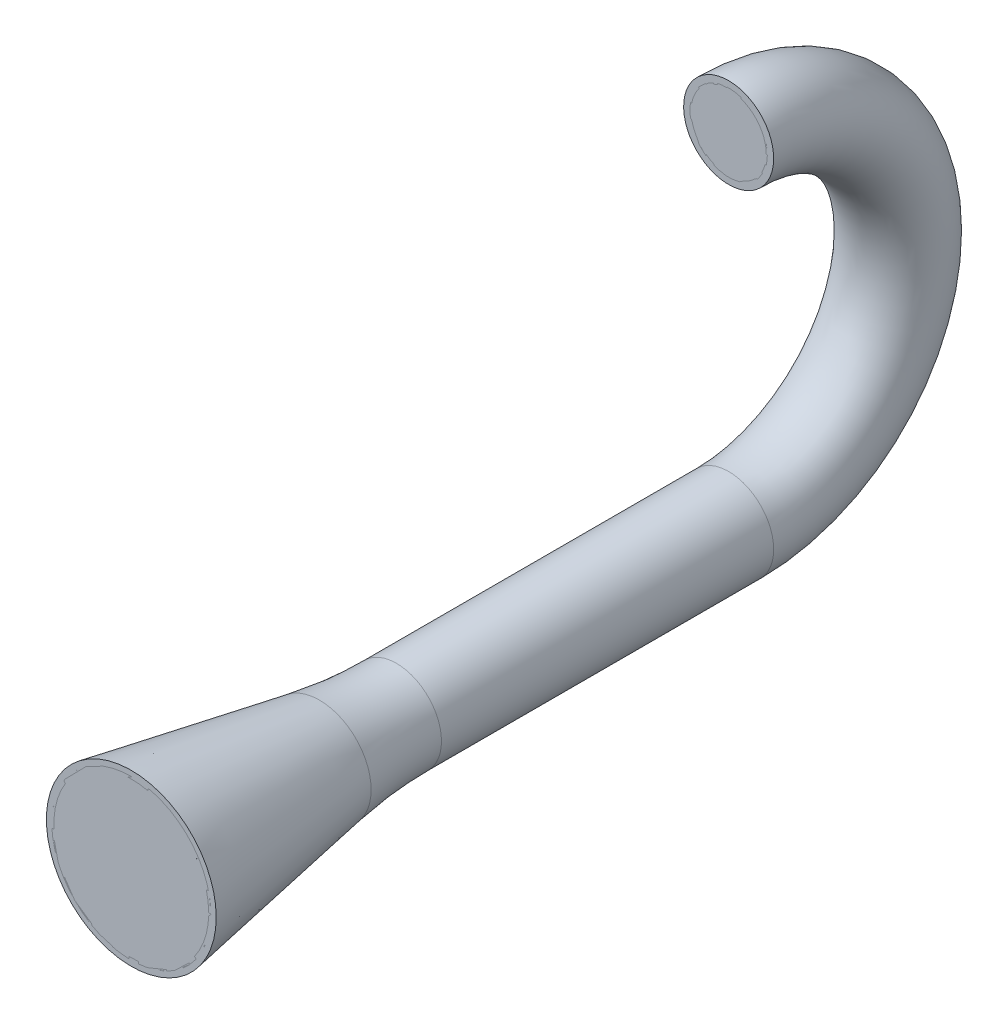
ISO-10303-21;
HEADER;
FILE_DESCRIPTION(('STEP AP214'),'2;1');
FILE_NAME('part.step','',(''),(''),'','','');
FILE_SCHEMA(('AUTOMOTIVE_DESIGN { 1 0 10303 214 1 1 1 1 }'));
ENDSEC;
DATA;
#1=APPLICATION_CONTEXT('core data for automotive mechanical design processes');
#2=APPLICATION_PROTOCOL_DEFINITION('international standard','automotive_design',2000,#1);
#3=PRODUCT_CONTEXT('',#1,'mechanical');
#4=PRODUCT('Part','Part','',(#3));
#5=PRODUCT_RELATED_PRODUCT_CATEGORY('part','',(#4));
#6=PRODUCT_DEFINITION_FORMATION('','',#4);
#7=PRODUCT_DEFINITION_CONTEXT('part definition',#1,'design');
#8=PRODUCT_DEFINITION('design','',#6,#7);
#9=PRODUCT_DEFINITION_SHAPE('','',#8);
#10=(LENGTH_UNIT() NAMED_UNIT(*) SI_UNIT(.MILLI.,.METRE.));
#11=(NAMED_UNIT(*) PLANE_ANGLE_UNIT() SI_UNIT($,.RADIAN.));
#12=(NAMED_UNIT(*) SI_UNIT($,.STERADIAN.) SOLID_ANGLE_UNIT());
#13=UNCERTAINTY_MEASURE_WITH_UNIT(LENGTH_MEASURE(1.E-05),#10,'distance_accuracy_value','');
#14=(GEOMETRIC_REPRESENTATION_CONTEXT(3) GLOBAL_UNCERTAINTY_ASSIGNED_CONTEXT((#13)) GLOBAL_UNIT_ASSIGNED_CONTEXT((#10,
#11,#12)) REPRESENTATION_CONTEXT('',''));
#15=CARTESIAN_POINT('',(0.,0.,0.));
#16=DIRECTION('',(0.,0.,1.));
#17=DIRECTION('',(1.,0.,0.));
#18=AXIS2_PLACEMENT_3D('',#15,#16,#17);
#19=CARTESIAN_POINT('',(0.,-114.3,0.));
#20=DIRECTION('',(0.,0.,1.));
#21=DIRECTION('',(1.,0.,0.));
#22=AXIS2_PLACEMENT_3D('',#19,#20,#21);
#23=CYLINDRICAL_SURFACE('',#22,25.4);
#24=DIRECTION('',(0.,0.,1.));
#25=VECTOR('',#24,1.);
#26=CARTESIAN_POINT('',(25.4,-114.3,221.338890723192));
#27=LINE('',#26,#25);
#28=CARTESIAN_POINT('',(25.4,-114.3,221.338890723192));
#29=VERTEX_POINT('',#28);
#30=CARTESIAN_POINT('',(25.4,-114.3,224.338890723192));
#31=VERTEX_POINT('',#30);
#32=EDGE_CURVE('P0_E90',#29,#31,#27,.T.);
#33=ORIENTED_EDGE('',*,*,#32,.F.);
#34=CARTESIAN_POINT('',(0.,-114.3,221.338890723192));
#35=DIRECTION('',(0.,0.,1.));
#36=DIRECTION('',(1.,0.,0.));
#37=AXIS2_PLACEMENT_3D('',#34,#35,#36);
#38=CIRCLE('',#37,25.4);
#39=CARTESIAN_POINT('',(-25.4,-114.3,221.338890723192));
#40=VERTEX_POINT('',#39);
#41=EDGE_CURVE('P0_E94',#29,#40,#38,.T.);
#42=ORIENTED_EDGE('',*,*,#41,.T.);
#43=DIRECTION('',(0.,0.,1.));
#44=VECTOR('',#43,1.);
#45=CARTESIAN_POINT('',(-25.4,-114.3,221.338890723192));
#46=LINE('',#45,#44);
#47=CARTESIAN_POINT('',(-25.4,-114.3,224.338890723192));
#48=VERTEX_POINT('',#47);
#49=EDGE_CURVE('P0_E81',#40,#48,#46,.T.);
#50=ORIENTED_EDGE('',*,*,#49,.T.);
#51=CARTESIAN_POINT('',(0.,-114.3,224.338890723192));
#52=DIRECTION('',(0.,0.,1.));
#53=DIRECTION('',(1.,0.,0.));
#54=AXIS2_PLACEMENT_3D('',#51,#52,#53);
#55=CIRCLE('',#54,25.4);
#56=EDGE_CURVE('P0_E127',#31,#48,#55,.F.);
#57=ORIENTED_EDGE('',*,*,#56,.F.);
#58=EDGE_LOOP('',(#33,#42,#50,#57));
#59=FACE_BOUND('',#58,.T.);
#60=CARTESIAN_POINT('',(0.,-114.3,0.));
#61=DIRECTION('',(0.,0.,-1.));
#62=DIRECTION('',(1.,0.,0.));
#63=AXIS2_PLACEMENT_3D('',#60,#61,#62);
#64=CIRCLE('',#63,25.4);
#65=CARTESIAN_POINT('',(-15.6575860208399,-94.3,0.));
#66=VERTEX_POINT('',#65);
#67=CARTESIAN_POINT('',(15.6575860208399,-94.3,0.));
#68=VERTEX_POINT('',#67);
#69=EDGE_CURVE('P0_E121',#66,#68,#64,.T.);
#70=ORIENTED_EDGE('',*,*,#69,.T.);
#71=DIRECTION('',(0.,0.,-1.));
#72=VECTOR('',#71,1.);
#73=CARTESIAN_POINT('',(15.6575860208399,-94.3,10.));
#74=LINE('',#73,#72);
#75=CARTESIAN_POINT('',(15.6575860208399,-94.3,10.));
#76=VERTEX_POINT('',#75);
#77=EDGE_CURVE('P0_E61',#76,#68,#74,.T.);
#78=ORIENTED_EDGE('',*,*,#77,.F.);
#79=CARTESIAN_POINT('',(0.,-114.3,10.));
#80=DIRECTION('',(0.,0.,1.));
#81=DIRECTION('',(1.,0.,0.));
#82=AXIS2_PLACEMENT_3D('',#79,#80,#81);
#83=CIRCLE('',#82,25.4);
#84=CARTESIAN_POINT('',(-15.6575860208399,-94.3,10.));
#85=VERTEX_POINT('',#84);
#86=EDGE_CURVE('P0_E103',#85,#76,#83,.T.);
#87=ORIENTED_EDGE('',*,*,#86,.F.);
#88=DIRECTION('',(0.,0.,-1.));
#89=VECTOR('',#88,1.);
#90=CARTESIAN_POINT('',(-15.6575860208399,-94.3,10.));
#91=LINE('',#90,#89);
#92=EDGE_CURVE('P0_E109',#85,#66,#91,.T.);
#93=ORIENTED_EDGE('',*,*,#92,.T.);
#94=EDGE_LOOP('',(#70,#78,#87,#93));
#95=FACE_BOUND('',#94,.T.);
#96=ADVANCED_FACE('P0_F37',(#59,#95),#23,.F.);
#97=CARTESIAN_POINT('',(0.,-114.3,0.));
#98=DIRECTION('',(0.,0.,1.));
#99=DIRECTION('',(1.,0.,0.));
#100=AXIS2_PLACEMENT_3D('',#97,#98,#99);
#101=CYLINDRICAL_SURFACE('',#100,30.4);
#102=CARTESIAN_POINT('',(0.,-114.3,224.338890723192));
#103=DIRECTION('',(0.,0.,1.));
#104=DIRECTION('',(1.,0.,0.));
#105=AXIS2_PLACEMENT_3D('',#102,#103,#104);
#106=CIRCLE('',#105,30.4);
#107=CARTESIAN_POINT('',(30.4,-114.3,224.338890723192));
#108=VERTEX_POINT('',#107);
#109=EDGE_CURVE('P0_E11',#108,#108,#106,.F.);
#110=ORIENTED_EDGE('',*,*,#109,.T.);
#111=EDGE_LOOP('',(#110));
#112=FACE_BOUND('',#111,.T.);
#113=CARTESIAN_POINT('',(0.,-114.3,0.));
#114=DIRECTION('',(0.,0.,1.));
#115=DIRECTION('',(0.,-1.,0.));
#116=AXIS2_PLACEMENT_3D('',#113,#114,#115);
#117=CIRCLE('',#116,30.4);
#118=CARTESIAN_POINT('',(0.,-144.7,0.));
#119=VERTEX_POINT('',#118);
#120=EDGE_CURVE('P0_E129',#119,#119,#117,.F.);
#121=ORIENTED_EDGE('',*,*,#120,.F.);
#122=EDGE_LOOP('',(#121));
#123=FACE_BOUND('',#122,.T.);
#124=ADVANCED_FACE('P0_F157',(#112,#123),#101,.T.);
#125=CARTESIAN_POINT('',(0.,0.,0.));
#126=DIRECTION('',(1.,0.,0.));
#127=DIRECTION('',(0.,0.,-1.));
#128=AXIS2_PLACEMENT_3D('',#125,#126,#127);
#129=TOROIDAL_SURFACE('',#128,114.3,30.4);
#130=CARTESIAN_POINT('',(0.,114.3,0.));
#131=DIRECTION('',(0.,0.,1.));
#132=DIRECTION('',(1.,0.,0.));
#133=AXIS2_PLACEMENT_3D('',#130,#131,#132);
#134=CIRCLE('',#133,30.4);
#135=CARTESIAN_POINT('',(0.,144.7,0.));
#136=VERTEX_POINT('',#135);
#137=EDGE_CURVE('P0_E132',#136,#136,#134,.T.);
#138=CARTESIAN_POINT('',(0.,0.,0.));
#139=DIRECTION('',(1.,0.,0.));
#140=DIRECTION('',(0.,0.,-1.));
#141=AXIS2_PLACEMENT_3D('',#138,#139,#140);
#142=CIRCLE('',#141,144.7);
#143=EDGE_CURVE('',#119,#136,#142,.T.);
#144=ORIENTED_EDGE('',*,*,#120,.T.);
#145=ORIENTED_EDGE('',*,*,#137,.F.);
#146=ORIENTED_EDGE('',*,*,#143,.T.);
#147=ORIENTED_EDGE('',*,*,#143,.F.);
#148=EDGE_LOOP('',(#144,#146,#145,#147));
#149=FACE_BOUND('',#148,.T.);
#150=ADVANCED_FACE('P0_F152',(#149),#129,.T.);
#151=CARTESIAN_POINT('',(0.,114.3,0.));
#152=DIRECTION('',(0.,0.,1.));
#153=DIRECTION('',(1.,0.,0.));
#154=AXIS2_PLACEMENT_3D('',#151,#152,#153);
#155=PLANE('',#154);
#156=CARTESIAN_POINT('',(0.,114.3,0.));
#157=DIRECTION('',(0.,0.,1.));
#158=DIRECTION('',(1.,0.,0.));
#159=AXIS2_PLACEMENT_3D('',#156,#157,#158);
#160=CIRCLE('',#159,25.4);
#161=CARTESIAN_POINT('',(25.4,114.3,0.));
#162=VERTEX_POINT('',#161);
#163=EDGE_CURVE('P0_E118',#162,#162,#160,.T.);
#164=ORIENTED_EDGE('',*,*,#163,.F.);
#165=EDGE_LOOP('',(#164));
#166=FACE_BOUND('',#165,.T.);
#167=ORIENTED_EDGE('',*,*,#137,.T.);
#168=EDGE_LOOP('',(#167));
#169=FACE_BOUND('',#168,.T.);
#170=ADVANCED_FACE('P0_F144',(#166,#169),#155,.T.);
#171=CARTESIAN_POINT('',(0.,-114.3,250.137194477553));
#172=DIRECTION('',(0.,0.,1.));
#173=DIRECTION('',(1.,0.,0.));
#174=AXIS2_PLACEMENT_3D('',#171,#172,#173);
#175=CONICAL_SURFACE('',#174,30.3240387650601,0.174532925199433);
#176=CARTESIAN_POINT('',(0.,-114.3,276.398614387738));
#177=DIRECTION('',(0.,0.,1.));
#178=DIRECTION('',(1.,0.,0.));
#179=AXIS2_PLACEMENT_3D('',#176,#177,#178);
#180=CIRCLE('',#179,34.95463564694);
#181=CARTESIAN_POINT('',(34.95463564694,-114.3,276.398614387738));
#182=VERTEX_POINT('',#181);
#183=EDGE_CURVE('P0_E46',#182,#182,#180,.T.);
#184=ORIENTED_EDGE('',*,*,#183,.T.);
#185=EDGE_LOOP('',(#184));
#186=FACE_BOUND('',#185,.T.);
#187=CARTESIAN_POINT('',(0.,-114.3,403.405435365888));
#188=DIRECTION('',(0.,0.,1.));
#189=DIRECTION('',(1.,0.,0.));
#190=AXIS2_PLACEMENT_3D('',#187,#188,#189);
#191=CIRCLE('',#190,57.3493649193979);
#192=CARTESIAN_POINT('',(57.3493649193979,-114.3,403.405435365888));
#193=VERTEX_POINT('',#192);
#194=EDGE_CURVE('P0_E41',#193,#193,#191,.T.);
#195=ORIENTED_EDGE('',*,*,#194,.F.);
#196=EDGE_LOOP('',(#195));
#197=FACE_BOUND('',#196,.T.);
#198=ADVANCED_FACE('P0_F142',(#186,#197),#175,.T.);
#199=CARTESIAN_POINT('',(0.,-114.3,403.405435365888));
#200=DIRECTION('',(0.,0.,1.));
#201=DIRECTION('',(1.,0.,0.));
#202=AXIS2_PLACEMENT_3D('',#199,#200,#201);
#203=PLANE('',#202);
#204=CARTESIAN_POINT('',(0.,-114.3,403.405435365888));
#205=DIRECTION('',(0.,0.,1.));
#206=DIRECTION('',(1.,0.,0.));
#207=AXIS2_PLACEMENT_3D('',#204,#205,#206);
#208=CIRCLE('',#207,52.2722318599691);
#209=CARTESIAN_POINT('',(52.2722318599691,-114.3,403.405435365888));
#210=VERTEX_POINT('',#209);
#211=EDGE_CURVE('P0_E115',#210,#210,#208,.T.);
#212=ORIENTED_EDGE('',*,*,#211,.F.);
#213=EDGE_LOOP('',(#212));
#214=FACE_BOUND('',#213,.T.);
#215=ORIENTED_EDGE('',*,*,#194,.T.);
#216=EDGE_LOOP('',(#215));
#217=FACE_BOUND('',#216,.T.);
#218=ADVANCED_FACE('P0_F140',(#214,#217),#203,.T.);
#219=CARTESIAN_POINT('',(0.,-114.3,224.338890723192));
#220=DIRECTION('',(0.,0.,1.));
#221=DIRECTION('',(1.,0.,0.));
#222=AXIS2_PLACEMENT_3D('',#219,#220,#221);
#223=TOROIDAL_SURFACE('',#222,330.2,299.8);
#224=ORIENTED_EDGE('',*,*,#109,.F.);
#225=EDGE_LOOP('',(#224));
#226=FACE_BOUND('',#225,.T.);
#227=ORIENTED_EDGE('',*,*,#183,.F.);
#228=EDGE_LOOP('',(#227));
#229=FACE_BOUND('',#228,.T.);
#230=ADVANCED_FACE('P0_F39',(#226,#229),#223,.F.);
#231=CARTESIAN_POINT('',(0.,0.,0.));
#232=DIRECTION('',(1.,0.,0.));
#233=DIRECTION('',(0.,0.,-1.));
#234=AXIS2_PLACEMENT_3D('',#231,#232,#233);
#235=TOROIDAL_SURFACE('',#234,114.3,25.4);
#236=EDGE_CURVE('P0_E122',#68,#66,#64,.T.);
#237=ORIENTED_EDGE('',*,*,#236,.F.);
#238=ORIENTED_EDGE('',*,*,#69,.F.);
#239=EDGE_LOOP('',(#237,#238));
#240=FACE_BOUND('',#239,.T.);
#241=ORIENTED_EDGE('',*,*,#163,.T.);
#242=EDGE_LOOP('',(#241));
#243=FACE_BOUND('',#242,.T.);
#244=ADVANCED_FACE('P0_F166',(#240,#243),#235,.F.);
#245=CARTESIAN_POINT('',(0.,-114.3,251.005435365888));
#246=DIRECTION('',(0.,0.,1.));
#247=DIRECTION('',(1.,0.,0.));
#248=AXIS2_PLACEMENT_3D('',#245,#246,#247);
#249=CONICAL_SURFACE('',#248,25.399999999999,0.174532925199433);
#250=CARTESIAN_POINT('',(0.,-114.3,277.266855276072));
#251=DIRECTION('',(0.,0.,1.));
#252=DIRECTION('',(1.,0.,0.));
#253=AXIS2_PLACEMENT_3D('',#250,#251,#252);
#254=CIRCLE('',#253,30.030596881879);
#255=CARTESIAN_POINT('',(30.030596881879,-114.3,277.266855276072));
#256=VERTEX_POINT('',#255);
#257=EDGE_CURVE('P0_E124',#256,#256,#254,.T.);
#258=ORIENTED_EDGE('',*,*,#257,.F.);
#259=EDGE_LOOP('',(#258));
#260=FACE_BOUND('',#259,.T.);
#261=ORIENTED_EDGE('',*,*,#211,.T.);
#262=EDGE_LOOP('',(#261));
#263=FACE_BOUND('',#262,.T.);
#264=ADVANCED_FACE('P0_F171',(#260,#263),#249,.F.);
#265=CARTESIAN_POINT('',(0.,-114.3,224.338890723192));
#266=DIRECTION('',(0.,0.,1.));
#267=DIRECTION('',(1.,0.,0.));
#268=AXIS2_PLACEMENT_3D('',#265,#266,#267);
#269=TOROIDAL_SURFACE('',#268,330.2,304.8);
#270=ORIENTED_EDGE('',*,*,#56,.T.);
#271=CARTESIAN_POINT('',(0.,-114.3,224.338890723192));
#272=DIRECTION('',(0.,0.,1.));
#273=DIRECTION('',(1.,0.,0.));
#274=AXIS2_PLACEMENT_3D('',#271,#272,#273);
#275=CIRCLE('',#274,25.4);
#276=EDGE_CURVE('P0_E97',#31,#48,#275,.T.);
#277=ORIENTED_EDGE('',*,*,#276,.F.);
#278=EDGE_LOOP('',(#270,#277));
#279=FACE_BOUND('',#278,.T.);
#280=ORIENTED_EDGE('',*,*,#257,.T.);
#281=EDGE_LOOP('',(#280));
#282=FACE_BOUND('',#281,.T.);
#283=ADVANCED_FACE('P0_F168',(#279,#282),#269,.T.);
#284=CARTESIAN_POINT('',(-15.6575860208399,-94.3,10.));
#285=DIRECTION('',(0.,-1.,0.));
#286=DIRECTION('',(0.,0.,-1.));
#287=AXIS2_PLACEMENT_3D('',#284,#285,#286);
#288=PLANE('',#287);
#289=DIRECTION('',(-1.,0.,0.));
#290=VECTOR('',#289,1.);
#291=CARTESIAN_POINT('',(-15.6575860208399,-94.3,0.));
#292=LINE('',#291,#290);
#293=EDGE_CURVE('P0_E101',#68,#66,#292,.T.);
#294=ORIENTED_EDGE('',*,*,#293,.T.);
#295=ORIENTED_EDGE('',*,*,#92,.F.);
#296=DIRECTION('',(-1.,0.,0.));
#297=VECTOR('',#296,1.);
#298=CARTESIAN_POINT('',(-15.6575860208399,-94.3,10.));
#299=LINE('',#298,#297);
#300=EDGE_CURVE('P0_E106',#76,#85,#299,.T.);
#301=ORIENTED_EDGE('',*,*,#300,.F.);
#302=ORIENTED_EDGE('',*,*,#77,.T.);
#303=EDGE_LOOP('',(#294,#295,#301,#302));
#304=FACE_BOUND('',#303,.T.);
#305=ADVANCED_FACE('P0_F170',(#304),#288,.F.);
#306=CARTESIAN_POINT('',(0.,-114.3,10.));
#307=DIRECTION('',(0.,0.,1.));
#308=DIRECTION('',(1.,0.,0.));
#309=AXIS2_PLACEMENT_3D('',#306,#307,#308);
#310=PLANE('',#309);
#311=ORIENTED_EDGE('',*,*,#86,.T.);
#312=ORIENTED_EDGE('',*,*,#300,.T.);
#313=EDGE_LOOP('',(#311,#312));
#314=FACE_BOUND('',#313,.T.);
#315=ADVANCED_FACE('P0_F232',(#314),#310,.T.);
#316=CARTESIAN_POINT('',(0.,-114.3,0.));
#317=DIRECTION('',(0.,0.,1.));
#318=DIRECTION('',(1.,0.,0.));
#319=AXIS2_PLACEMENT_3D('',#316,#317,#318);
#320=PLANE('',#319);
#321=ORIENTED_EDGE('',*,*,#236,.T.);
#322=ORIENTED_EDGE('',*,*,#293,.F.);
#323=EDGE_LOOP('',(#321,#322));
#324=FACE_BOUND('',#323,.T.);
#325=ADVANCED_FACE('P0_F242',(#324),#320,.F.);
#326=CARTESIAN_POINT('',(-25.4,-114.3,221.338890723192));
#327=DIRECTION('',(0.,-1.,0.));
#328=DIRECTION('',(0.,0.,-1.));
#329=AXIS2_PLACEMENT_3D('',#326,#327,#328);
#330=PLANE('',#329);
#331=DIRECTION('',(1.,0.,0.));
#332=VECTOR('',#331,1.);
#333=CARTESIAN_POINT('',(-25.4,-114.3,224.338890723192));
#334=LINE('',#333,#332);
#335=EDGE_CURVE('P0_E53',#48,#31,#334,.T.);
#336=ORIENTED_EDGE('',*,*,#335,.F.);
#337=ORIENTED_EDGE('',*,*,#49,.F.);
#338=DIRECTION('',(1.,0.,0.));
#339=VECTOR('',#338,1.);
#340=CARTESIAN_POINT('',(-25.4,-114.3,221.338890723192));
#341=LINE('',#340,#339);
#342=EDGE_CURVE('P0_E84',#40,#29,#341,.T.);
#343=ORIENTED_EDGE('',*,*,#342,.T.);
#344=ORIENTED_EDGE('',*,*,#32,.T.);
#345=EDGE_LOOP('',(#336,#337,#343,#344));
#346=FACE_BOUND('',#345,.T.);
#347=ADVANCED_FACE('P0_F83',(#346),#330,.T.);
#348=CARTESIAN_POINT('',(0.,-114.3,221.338890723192));
#349=DIRECTION('',(0.,0.,1.));
#350=DIRECTION('',(1.,0.,0.));
#351=AXIS2_PLACEMENT_3D('',#348,#349,#350);
#352=PLANE('',#351);
#353=ORIENTED_EDGE('',*,*,#41,.F.);
#354=ORIENTED_EDGE('',*,*,#342,.F.);
#355=EDGE_LOOP('',(#353,#354));
#356=FACE_BOUND('',#355,.T.);
#357=ADVANCED_FACE('P0_F93',(#356),#352,.F.);
#358=CARTESIAN_POINT('',(0.,-114.3,224.338890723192));
#359=DIRECTION('',(0.,0.,1.));
#360=DIRECTION('',(1.,0.,0.));
#361=AXIS2_PLACEMENT_3D('',#358,#359,#360);
#362=PLANE('',#361);
#363=ORIENTED_EDGE('',*,*,#276,.T.);
#364=ORIENTED_EDGE('',*,*,#335,.T.);
#365=EDGE_LOOP('',(#363,#364));
#366=FACE_BOUND('',#365,.T.);
#367=ADVANCED_FACE('P0_F281',(#366),#362,.T.);
#368=CLOSED_SHELL('',(#96,#124,#150,#170,#198,#218,#230,#244,#264,#283,#305,#315,#325,#347,#357,#367));
#369=MANIFOLD_SOLID_BREP('P0_B2',#368);
#370=CARTESIAN_POINT('',(26.1184204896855,114.3,-3.17835325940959));
#371=CARTESIAN_POINT('',(26.1184204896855,116.009432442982,-3.17835325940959));
#372=CARTESIAN_POINT('',(25.7816916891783,119.428297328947,-3.17835325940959));
#373=CARTESIAN_POINT('',(24.2858225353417,124.359517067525,-3.17835325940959));
#374=CARTESIAN_POINT('',(21.8566628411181,128.90415520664,-3.17835325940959));
#375=CARTESIAN_POINT('',(18.587563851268,132.887563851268,-3.17835325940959));
#376=CARTESIAN_POINT('',(14.6041552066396,136.156662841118,-3.17835325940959));
#377=CARTESIAN_POINT('',(10.0595170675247,138.585822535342,-3.17835325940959));
#378=CARTESIAN_POINT('',(5.12829732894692,140.081691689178,-3.17835325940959));
#379=CARTESIAN_POINT('',(0.,140.586784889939,-3.17835325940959));
#380=CARTESIAN_POINT('',(-5.12829732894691,140.081691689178,-3.17835325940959));
#381=CARTESIAN_POINT('',(-10.0595170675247,138.585822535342,-3.17835325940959));
#382=CARTESIAN_POINT('',(-14.6041552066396,136.156662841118,-3.17835325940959));
#383=CARTESIAN_POINT('',(-18.587563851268,132.887563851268,-3.17835325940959));
#384=CARTESIAN_POINT('',(-21.8566628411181,128.90415520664,-3.17835325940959));
#385=CARTESIAN_POINT('',(-24.2858225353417,124.359517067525,-3.17835325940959));
#386=CARTESIAN_POINT('',(-25.7816916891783,119.428297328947,-3.17835325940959));
#387=CARTESIAN_POINT('',(-26.2867848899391,114.3,-3.17835325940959));
#388=CARTESIAN_POINT('',(-25.7816916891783,109.171702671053,-3.17835325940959));
#389=CARTESIAN_POINT('',(-24.2858225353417,104.240482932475,-3.17835325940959));
#390=CARTESIAN_POINT('',(-21.8566628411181,99.6958447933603,-3.17835325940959));
#391=CARTESIAN_POINT('',(-18.587563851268,95.712436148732,-3.17835325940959));
#392=CARTESIAN_POINT('',(-14.6041552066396,92.4433371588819,-3.17835325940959));
#393=CARTESIAN_POINT('',(-10.0595170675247,90.0141774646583,-3.17835325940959));
#394=CARTESIAN_POINT('',(-5.12829732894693,88.5183083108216,-3.17835325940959));
#395=CARTESIAN_POINT('',(0.,88.0132151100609,-3.17835325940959));
#396=CARTESIAN_POINT('',(5.12829732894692,88.5183083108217,-3.17835325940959));
#397=CARTESIAN_POINT('',(10.0595170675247,90.0141774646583,-3.17835325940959));
#398=CARTESIAN_POINT('',(14.6041552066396,92.4433371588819,-3.17835325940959));
#399=CARTESIAN_POINT('',(18.587563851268,95.7124361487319,-3.17835325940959));
#400=CARTESIAN_POINT('',(21.8566628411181,99.6958447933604,-3.17835325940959));
#401=CARTESIAN_POINT('',(24.2858225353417,104.240482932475,-3.17835325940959));
#402=CARTESIAN_POINT('',(25.7816916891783,109.171702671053,-3.17835325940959));
#403=CARTESIAN_POINT('',(26.1184204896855,112.590567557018,-3.17835325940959));
#404=CARTESIAN_POINT('',(26.1184204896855,114.3,-3.17835325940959));
#405=B_SPLINE_CURVE_WITH_KNOTS('',3,(#370,#371,#372,#373,#374,#375,#376,#377,#378,#379,#380,
#381,#382,#383,#384,#385,#386,#387,#388,#389,#390,#391,#392,#393,#394,#395,#396,#397,#398,#399,
#400,#401,#402,#403,#404),.UNSPECIFIED.,.T.,.F.,(4,1,1,1,1,1,1,1,1,1,1,1,1,1,1,1,1,1,1,1,1,1,1,
1,1,1,1,1,1,1,1,1,4),(0.,0.03125,0.0625,0.0937500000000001,0.125,0.15625,0.1875,0.21875,0.25,
0.28125,0.3125,0.34375,0.375,0.40625,0.4375,0.46875,0.5,0.53125,0.5625,0.59375,0.625,0.65625,
0.6875,0.71875,0.75,0.78125,0.8125,0.84375,0.875,0.90625,0.9375,0.96875,1.),.UNSPECIFIED.);
#406=DIRECTION('',(0.,0.,1.));
#407=VECTOR('',#406,1.);
#408=SURFACE_OF_LINEAR_EXTRUSION('',#405,#407);
#409=CARTESIAN_POINT('',(26.1184204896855,114.3,-3.17835325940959));
#410=CARTESIAN_POINT('',(26.1184204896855,116.009432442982,-3.17835325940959));
#411=CARTESIAN_POINT('',(25.7816916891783,119.428297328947,-3.17835325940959));
#412=CARTESIAN_POINT('',(24.2858225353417,124.359517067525,-3.17835325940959));
#413=CARTESIAN_POINT('',(21.8566628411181,128.90415520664,-3.17835325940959));
#414=CARTESIAN_POINT('',(18.587563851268,132.887563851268,-3.17835325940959));
#415=CARTESIAN_POINT('',(14.6041552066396,136.156662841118,-3.17835325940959));
#416=CARTESIAN_POINT('',(10.0595170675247,138.585822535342,-3.17835325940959));
#417=CARTESIAN_POINT('',(5.12829732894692,140.081691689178,-3.17835325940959));
#418=CARTESIAN_POINT('',(0.,140.586784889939,-3.17835325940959));
#419=CARTESIAN_POINT('',(-5.12829732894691,140.081691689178,-3.17835325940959));
#420=CARTESIAN_POINT('',(-10.0595170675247,138.585822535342,-3.17835325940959));
#421=CARTESIAN_POINT('',(-14.6041552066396,136.156662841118,-3.17835325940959));
#422=CARTESIAN_POINT('',(-18.587563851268,132.887563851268,-3.17835325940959));
#423=CARTESIAN_POINT('',(-21.8566628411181,128.90415520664,-3.17835325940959));
#424=CARTESIAN_POINT('',(-24.2858225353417,124.359517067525,-3.17835325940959));
#425=CARTESIAN_POINT('',(-25.7816916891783,119.428297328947,-3.17835325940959));
#426=CARTESIAN_POINT('',(-26.2867848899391,114.3,-3.17835325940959));
#427=CARTESIAN_POINT('',(-25.7816916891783,109.171702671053,-3.17835325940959));
#428=CARTESIAN_POINT('',(-24.2858225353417,104.240482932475,-3.17835325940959));
#429=CARTESIAN_POINT('',(-21.8566628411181,99.6958447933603,-3.17835325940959));
#430=CARTESIAN_POINT('',(-18.587563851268,95.712436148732,-3.17835325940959));
#431=CARTESIAN_POINT('',(-14.6041552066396,92.4433371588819,-3.17835325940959));
#432=CARTESIAN_POINT('',(-10.0595170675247,90.0141774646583,-3.17835325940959));
#433=CARTESIAN_POINT('',(-5.12829732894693,88.5183083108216,-3.17835325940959));
#434=CARTESIAN_POINT('',(0.,88.0132151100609,-3.17835325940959));
#435=CARTESIAN_POINT('',(5.12829732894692,88.5183083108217,-3.17835325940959));
#436=CARTESIAN_POINT('',(10.0595170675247,90.0141774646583,-3.17835325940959));
#437=CARTESIAN_POINT('',(14.6041552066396,92.4433371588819,-3.17835325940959));
#438=CARTESIAN_POINT('',(18.587563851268,95.7124361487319,-3.17835325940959));
#439=CARTESIAN_POINT('',(21.8566628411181,99.6958447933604,-3.17835325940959));
#440=CARTESIAN_POINT('',(24.2858225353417,104.240482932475,-3.17835325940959));
#441=CARTESIAN_POINT('',(25.7816916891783,109.171702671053,-3.17835325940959));
#442=CARTESIAN_POINT('',(26.1184204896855,112.590567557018,-3.17835325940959));
#443=CARTESIAN_POINT('',(26.1184204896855,114.3,-3.17835325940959));
#444=B_SPLINE_CURVE_WITH_KNOTS('',3,(#409,#410,#411,#412,#413,#414,#415,#416,#417,#418,#419,
#420,#421,#422,#423,#424,#425,#426,#427,#428,#429,#430,#431,#432,#433,#434,#435,#436,#437,#438,
#439,#440,#441,#442,#443),.UNSPECIFIED.,.T.,.F.,(4,1,1,1,1,1,1,1,1,1,1,1,1,1,1,1,1,1,1,1,1,1,1,
1,1,1,1,1,1,1,1,1,4),(0.,0.03125,0.0625,0.0937500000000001,0.125,0.15625,0.1875,0.21875,0.25,
0.28125,0.3125,0.34375,0.375,0.40625,0.4375,0.46875,0.5,0.53125,0.5625,0.59375,0.625,0.65625,
0.6875,0.71875,0.75,0.78125,0.8125,0.84375,0.875,0.90625,0.9375,0.96875,1.),.UNSPECIFIED.);
#445=CARTESIAN_POINT('',(26.1184204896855,114.3,-3.17835325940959));
#446=VERTEX_POINT('',#445);
#447=EDGE_CURVE('P1_E10',#446,#446,#444,.T.);
#448=ORIENTED_EDGE('',*,*,#447,.T.);
#449=EDGE_LOOP('',(#448));
#450=FACE_BOUND('',#449,.T.);
#451=CARTESIAN_POINT('',(26.1184204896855,114.3,0.));
#452=CARTESIAN_POINT('',(26.1184204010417,113.872639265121,0.));
#453=CARTESIAN_POINT('',(26.1078975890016,113.445281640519,0.));
#454=CARTESIAN_POINT('',(26.0659076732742,112.591592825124,0.));
#455=CARTESIAN_POINT('',(26.0344404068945,112.16526164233,0.));
#456=CARTESIAN_POINT('',(25.9506627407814,111.314652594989,0.));
#457=CARTESIAN_POINT('',(25.898352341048,110.890374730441,0.));
#458=CARTESIAN_POINT('',(25.7729888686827,110.044896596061,0.));
#459=CARTESIAN_POINT('',(25.6999359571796,109.623696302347,0.));
#460=CARTESIAN_POINT('',(25.5331887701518,108.785401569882,0.));
#461=CARTESIAN_POINT('',(25.4394944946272,108.368307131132,0.));
#462=CARTESIAN_POINT('',(25.2317647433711,107.539212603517,0.));
#463=CARTESIAN_POINT('',(25.1177291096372,107.127212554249,0.));
#464=CARTESIAN_POINT('',(24.8696156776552,106.309292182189,0.));
#465=CARTESIAN_POINT('',(24.7355378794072,105.903371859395,0.));
#466=CARTESIAN_POINT('',(24.4476386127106,105.098596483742,0.));
#467=CARTESIAN_POINT('',(24.2938172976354,104.699741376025,0.));
#468=CARTESIAN_POINT('',(23.9667309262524,103.91008502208,0.));
#469=CARTESIAN_POINT('',(23.7934658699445,103.519283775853,0.));
#470=CARTESIAN_POINT('',(23.4279792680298,102.746646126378,0.));
#471=CARTESIAN_POINT('',(23.2357575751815,102.364809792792,0.));
#472=CARTESIAN_POINT('',(22.8328432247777,101.611010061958,0.));
#473=CARTESIAN_POINT('',(22.6221505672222,101.239046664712,0.));
#474=CARTESIAN_POINT('',(22.1827793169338,100.505901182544,0.));
#475=CARTESIAN_POINT('',(21.9541008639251,100.144719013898,0.));
#476=CARTESIAN_POINT('',(21.4792450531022,99.4340470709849,0.));
#477=CARTESIAN_POINT('',(21.2330676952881,99.0845572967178,0.));
#478=CARTESIAN_POINT('',(20.7238696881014,98.3980685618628,0.));
#479=CARTESIAN_POINT('',(20.460848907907,98.0610696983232,0.));
#480=CARTESIAN_POINT('',(19.9186174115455,97.4003587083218,0.));
#481=CARTESIAN_POINT('',(19.6394066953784,97.07664658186,0.));
#482=CARTESIAN_POINT('',(19.0654482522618,96.4433053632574,0.));
#483=CARTESIAN_POINT('',(18.7707006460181,96.1336761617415,0.));
#484=CARTESIAN_POINT('',(18.1663238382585,95.5292993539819,0.));
#485=CARTESIAN_POINT('',(17.8566946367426,95.2345517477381,0.));
#486=CARTESIAN_POINT('',(17.22335341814,94.6605933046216,0.));
#487=CARTESIAN_POINT('',(16.8996412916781,94.3813825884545,0.));
#488=CARTESIAN_POINT('',(16.2389303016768,93.8391510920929,0.));
#489=CARTESIAN_POINT('',(15.9019314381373,93.5761303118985,0.));
#490=CARTESIAN_POINT('',(15.2154427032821,93.0669323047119,0.));
#491=CARTESIAN_POINT('',(14.8659529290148,92.8207549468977,0.));
#492=CARTESIAN_POINT('',(14.1552809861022,92.3458991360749,0.));
#493=CARTESIAN_POINT('',(13.7940988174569,92.1172206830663,0.));
#494=CARTESIAN_POINT('',(13.0609533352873,91.6778494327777,0.));
#495=CARTESIAN_POINT('',(12.6889899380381,91.4671567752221,0.));
#496=CARTESIAN_POINT('',(11.9351902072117,91.0642424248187,0.));
#497=CARTESIAN_POINT('',(11.5533538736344,90.8720207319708,0.));
#498=CARTESIAN_POINT('',(10.7807162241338,90.5065341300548,0.));
#499=CARTESIAN_POINT('',(10.389914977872,90.3332690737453,0.));
#500=CARTESIAN_POINT('',(9.60025862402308,90.0061827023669,0.));
#501=CARTESIAN_POINT('',(9.201403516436,89.8523613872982,0.));
#502=CARTESIAN_POINT('',(8.3966281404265,89.5644621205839,0.));
#503=CARTESIAN_POINT('',(7.99070781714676,89.4303843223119,0.));
#504=CARTESIAN_POINT('',(7.17278744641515,89.1822708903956,0.));
#505=CARTESIAN_POINT('',(6.76078739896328,89.0682352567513,0.));
#506=CARTESIAN_POINT('',(5.9316928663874,88.8605055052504,0.));
#507=CARTESIAN_POINT('',(5.51459842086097,88.7668112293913,0.));
#508=CARTESIAN_POINT('',(4.67630370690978,88.6000640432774,0.));
#509=CARTESIAN_POINT('',(4.25510343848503,88.5270111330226,0.));
#510=CARTESIAN_POINT('',(3.40962523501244,88.4016476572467,0.));
#511=CARTESIAN_POINT('',(2.98534727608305,88.3493372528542,0.));
#512=CARTESIAN_POINT('',(2.13473848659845,88.2655595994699,0.));
#513=CARTESIAN_POINT('',(1.70840765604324,88.2340923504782,0.));
#514=CARTESIAN_POINT('',(0.85471787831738,88.1921023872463,0.));
#515=CARTESIAN_POINT('',(0.427358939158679,88.1815795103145,0.));
#516=CARTESIAN_POINT('',(-0.427358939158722,88.1815795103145,0.));
#517=CARTESIAN_POINT('',(-0.854717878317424,88.1921023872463,0.));
#518=CARTESIAN_POINT('',(-1.70840765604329,88.2340923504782,0.));
#519=CARTESIAN_POINT('',(-2.13473848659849,88.2655595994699,0.));
#520=CARTESIAN_POINT('',(-2.98534727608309,88.3493372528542,0.));
#521=CARTESIAN_POINT('',(-3.40962523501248,88.4016476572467,0.));
#522=CARTESIAN_POINT('',(-4.25510343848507,88.5270111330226,0.));
#523=CARTESIAN_POINT('',(-4.67630370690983,88.6000640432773,0.));
#524=CARTESIAN_POINT('',(-5.51459842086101,88.7668112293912,0.));
#525=CARTESIAN_POINT('',(-5.93169286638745,88.8605055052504,0.));
#526=CARTESIAN_POINT('',(-6.76078739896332,89.0682352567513,0.));
#527=CARTESIAN_POINT('',(-7.17278744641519,89.1822708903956,0.));
#528=CARTESIAN_POINT('',(-7.9907078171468,89.430384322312,0.));
#529=CARTESIAN_POINT('',(-8.39662814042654,89.564462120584,0.));
#530=CARTESIAN_POINT('',(-9.20140351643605,89.8523613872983,0.));
#531=CARTESIAN_POINT('',(-9.60025862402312,90.006182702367,0.));
#532=CARTESIAN_POINT('',(-10.389914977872,90.3332690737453,0.));
#533=CARTESIAN_POINT('',(-10.7807162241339,90.5065341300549,0.));
#534=CARTESIAN_POINT('',(-11.5533538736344,90.8720207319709,0.));
#535=CARTESIAN_POINT('',(-11.9351902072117,91.0642424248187,0.));
#536=CARTESIAN_POINT('',(-12.6889899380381,91.4671567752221,0.));
#537=CARTESIAN_POINT('',(-13.0609533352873,91.6778494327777,0.));
#538=CARTESIAN_POINT('',(-13.7940988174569,92.1172206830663,0.));
#539=CARTESIAN_POINT('',(-14.1552809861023,92.3458991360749,0.));
#540=CARTESIAN_POINT('',(-14.8659529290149,92.8207549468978,0.));
#541=CARTESIAN_POINT('',(-15.2154427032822,93.0669323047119,0.));
#542=CARTESIAN_POINT('',(-15.9019314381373,93.5761303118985,0.));
#543=CARTESIAN_POINT('',(-16.2389303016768,93.8391510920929,0.));
#544=CARTESIAN_POINT('',(-16.8996412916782,94.3813825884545,0.));
#545=CARTESIAN_POINT('',(-17.22335341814,94.6605933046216,0.));
#546=CARTESIAN_POINT('',(-17.8566946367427,95.2345517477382,0.));
#547=CARTESIAN_POINT('',(-18.1663238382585,95.5292993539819,0.));
#548=CARTESIAN_POINT('',(-18.7707006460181,96.1336761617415,0.));
#549=CARTESIAN_POINT('',(-19.0654482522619,96.4433053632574,0.));
#550=CARTESIAN_POINT('',(-19.6394066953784,97.07664658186,0.));
#551=CARTESIAN_POINT('',(-19.9186174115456,97.4003587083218,0.));
#552=CARTESIAN_POINT('',(-20.4608489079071,98.0610696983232,0.));
#553=CARTESIAN_POINT('',(-20.7238696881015,98.3980685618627,0.));
#554=CARTESIAN_POINT('',(-21.2330676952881,99.0845572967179,0.));
#555=CARTESIAN_POINT('',(-21.4792450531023,99.4340470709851,0.));
#556=CARTESIAN_POINT('',(-21.9541008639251,100.144719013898,0.));
#557=CARTESIAN_POINT('',(-22.1827793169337,100.505901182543,0.));
#558=CARTESIAN_POINT('',(-22.6221505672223,101.239046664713,0.));
#559=CARTESIAN_POINT('',(-22.8328432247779,101.611010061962,0.));
#560=CARTESIAN_POINT('',(-23.2357575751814,102.364809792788,0.));
#561=CARTESIAN_POINT('',(-23.4279792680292,102.746646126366,0.));
#562=CARTESIAN_POINT('',(-23.7934658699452,103.519283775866,0.));
#563=CARTESIAN_POINT('',(-23.9667309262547,103.910085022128,0.));
#564=CARTESIAN_POINT('',(-24.2938172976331,104.699741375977,0.));
#565=CARTESIAN_POINT('',(-24.4476386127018,105.098596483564,0.));
#566=CARTESIAN_POINT('',(-24.7355378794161,105.903371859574,0.));
#567=CARTESIAN_POINT('',(-24.8696156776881,106.309292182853,0.));
#568=CARTESIAN_POINT('',(-25.1177291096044,107.127212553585,0.));
#569=CARTESIAN_POINT('',(-25.2317647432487,107.539212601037,0.));
#570=CARTESIAN_POINT('',(-25.4394944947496,108.368307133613,0.));
#571=CARTESIAN_POINT('',(-25.5331887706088,108.785401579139,0.));
#572=CARTESIAN_POINT('',(-25.6999359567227,109.62369629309,0.));
#573=CARTESIAN_POINT('',(-25.7729888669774,110.044896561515,0.));
#574=CARTESIAN_POINT('',(-25.8983523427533,110.890374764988,0.));
#575=CARTESIAN_POINT('',(-25.9506627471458,111.314652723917,0.));
#576=CARTESIAN_POINT('',(-26.0344404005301,112.165261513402,0.));
#577=CARTESIAN_POINT('',(-26.0659076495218,112.591592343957,0.));
#578=CARTESIAN_POINT('',(-26.1078976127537,113.445282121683,0.));
#579=CARTESIAN_POINT('',(-26.1184204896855,113.872641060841,0.));
#580=CARTESIAN_POINT('',(-26.1184204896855,114.727358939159,0.));
#581=CARTESIAN_POINT('',(-26.1078976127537,115.154717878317,0.));
#582=CARTESIAN_POINT('',(-26.0659076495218,116.008407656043,0.));
#583=CARTESIAN_POINT('',(-26.0344404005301,116.434738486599,0.));
#584=CARTESIAN_POINT('',(-25.9506627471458,117.285347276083,0.));
#585=CARTESIAN_POINT('',(-25.8983523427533,117.709625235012,0.));
#586=CARTESIAN_POINT('',(-25.7729888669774,118.555103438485,0.));
#587=CARTESIAN_POINT('',(-25.6999359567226,118.97630370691,0.));
#588=CARTESIAN_POINT('',(-25.5331887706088,119.814598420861,0.));
#589=CARTESIAN_POINT('',(-25.4394944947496,120.231692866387,0.));
#590=CARTESIAN_POINT('',(-25.2317647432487,121.060787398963,0.));
#591=CARTESIAN_POINT('',(-25.1177291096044,121.472787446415,0.));
#592=CARTESIAN_POINT('',(-24.869615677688,122.290707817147,0.));
#593=CARTESIAN_POINT('',(-24.735537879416,122.696628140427,0.));
#594=CARTESIAN_POINT('',(-24.4476386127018,123.501403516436,0.));
#595=CARTESIAN_POINT('',(-24.293817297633,123.900258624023,0.));
#596=CARTESIAN_POINT('',(-23.9667309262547,124.689914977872,0.));
#597=CARTESIAN_POINT('',(-23.7934658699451,125.080716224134,0.));
#598=CARTESIAN_POINT('',(-23.4279792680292,125.853353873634,0.));
#599=CARTESIAN_POINT('',(-23.2357575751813,126.235190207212,0.));
#600=CARTESIAN_POINT('',(-22.8328432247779,126.988989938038,0.));
#601=CARTESIAN_POINT('',(-22.6221505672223,127.360953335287,0.));
#602=CARTESIAN_POINT('',(-22.1827793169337,128.094098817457,0.));
#603=CARTESIAN_POINT('',(-21.9541008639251,128.455280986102,0.));
#604=CARTESIAN_POINT('',(-21.4792450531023,129.165952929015,0.));
#605=CARTESIAN_POINT('',(-21.2330676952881,129.515442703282,0.));
#606=CARTESIAN_POINT('',(-20.7238696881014,130.201931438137,0.));
#607=CARTESIAN_POINT('',(-20.460848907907,130.538930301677,0.));
#608=CARTESIAN_POINT('',(-19.9186174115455,131.199641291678,0.));
#609=CARTESIAN_POINT('',(-19.6394066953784,131.52335341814,0.));
#610=CARTESIAN_POINT('',(-19.0654482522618,132.156694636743,0.));
#611=CARTESIAN_POINT('',(-18.7707006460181,132.466323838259,0.));
#612=CARTESIAN_POINT('',(-18.1663238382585,133.070700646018,0.));
#613=CARTESIAN_POINT('',(-17.8566946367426,133.365448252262,0.));
#614=CARTESIAN_POINT('',(-17.22335341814,133.939406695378,0.));
#615=CARTESIAN_POINT('',(-16.8996412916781,134.218617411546,0.));
#616=CARTESIAN_POINT('',(-16.2389303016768,134.760848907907,0.));
#617=CARTESIAN_POINT('',(-15.9019314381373,135.023869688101,0.));
#618=CARTESIAN_POINT('',(-15.2154427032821,135.533067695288,0.));
#619=CARTESIAN_POINT('',(-14.8659529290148,135.779245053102,0.));
#620=CARTESIAN_POINT('',(-14.1552809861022,136.254100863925,0.));
#621=CARTESIAN_POINT('',(-13.7940988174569,136.482779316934,0.));
#622=CARTESIAN_POINT('',(-13.0609533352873,136.922150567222,0.));
#623=CARTESIAN_POINT('',(-12.6889899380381,137.132843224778,0.));
#624=CARTESIAN_POINT('',(-11.9351902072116,137.535757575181,0.));
#625=CARTESIAN_POINT('',(-11.5533538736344,137.727979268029,0.));
#626=CARTESIAN_POINT('',(-10.7807162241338,138.093465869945,0.));
#627=CARTESIAN_POINT('',(-10.389914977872,138.266730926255,0.));
#628=CARTESIAN_POINT('',(-9.60025862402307,138.593817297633,0.));
#629=CARTESIAN_POINT('',(-9.201403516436,138.747638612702,0.));
#630=CARTESIAN_POINT('',(-8.39662814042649,139.035537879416,0.));
#631=CARTESIAN_POINT('',(-7.99070781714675,139.169615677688,0.));
#632=CARTESIAN_POINT('',(-7.17278744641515,139.417729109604,0.));
#633=CARTESIAN_POINT('',(-6.76078739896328,139.531764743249,0.));
#634=CARTESIAN_POINT('',(-5.9316928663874,139.73949449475,0.));
#635=CARTESIAN_POINT('',(-5.51459842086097,139.833188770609,0.));
#636=CARTESIAN_POINT('',(-4.67630370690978,139.999935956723,0.));
#637=CARTESIAN_POINT('',(-4.25510343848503,140.072988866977,0.));
#638=CARTESIAN_POINT('',(-3.40962523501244,140.198352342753,0.));
#639=CARTESIAN_POINT('',(-2.98534727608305,140.250662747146,0.));
#640=CARTESIAN_POINT('',(-2.13473848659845,140.33444040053,0.));
#641=CARTESIAN_POINT('',(-1.70840765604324,140.365907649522,0.));
#642=CARTESIAN_POINT('',(-0.854717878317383,140.407897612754,0.));
#643=CARTESIAN_POINT('',(-0.427358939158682,140.418420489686,0.));
#644=CARTESIAN_POINT('',(0.427358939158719,140.418420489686,0.));
#645=CARTESIAN_POINT('',(0.854717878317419,140.407897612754,0.));
#646=CARTESIAN_POINT('',(1.70840765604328,140.365907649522,0.));
#647=CARTESIAN_POINT('',(2.13473848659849,140.33444040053,0.));
#648=CARTESIAN_POINT('',(2.98534727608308,140.250662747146,0.));
#649=CARTESIAN_POINT('',(3.40962523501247,140.198352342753,0.));
#650=CARTESIAN_POINT('',(4.25510343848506,140.072988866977,0.));
#651=CARTESIAN_POINT('',(4.67630370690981,139.999935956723,0.));
#652=CARTESIAN_POINT('',(5.51459842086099,139.833188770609,0.));
#653=CARTESIAN_POINT('',(5.93169286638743,139.73949449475,0.));
#654=CARTESIAN_POINT('',(6.76078739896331,139.531764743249,0.));
#655=CARTESIAN_POINT('',(7.17278744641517,139.417729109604,0.));
#656=CARTESIAN_POINT('',(7.99070781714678,139.169615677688,0.));
#657=CARTESIAN_POINT('',(8.39662814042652,139.035537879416,0.));
#658=CARTESIAN_POINT('',(9.20140351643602,138.747638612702,0.));
#659=CARTESIAN_POINT('',(9.60025862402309,138.593817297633,0.));
#660=CARTESIAN_POINT('',(10.389914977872,138.266730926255,0.));
#661=CARTESIAN_POINT('',(10.7807162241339,138.093465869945,0.));
#662=CARTESIAN_POINT('',(11.5533538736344,137.727979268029,0.));
#663=CARTESIAN_POINT('',(11.9351902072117,137.535757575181,0.));
#664=CARTESIAN_POINT('',(12.6889899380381,137.132843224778,0.));
#665=CARTESIAN_POINT('',(13.0609533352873,136.922150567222,0.));
#666=CARTESIAN_POINT('',(13.7940988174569,136.482779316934,0.));
#667=CARTESIAN_POINT('',(14.1552809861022,136.254100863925,0.));
#668=CARTESIAN_POINT('',(14.8659529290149,135.779245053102,0.));
#669=CARTESIAN_POINT('',(15.2154427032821,135.533067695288,0.));
#670=CARTESIAN_POINT('',(15.9019314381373,135.023869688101,0.));
#671=CARTESIAN_POINT('',(16.2389303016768,134.760848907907,0.));
#672=CARTESIAN_POINT('',(16.8996412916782,134.218617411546,0.));
#673=CARTESIAN_POINT('',(17.22335341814,133.939406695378,0.));
#674=CARTESIAN_POINT('',(17.8566946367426,133.365448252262,0.));
#675=CARTESIAN_POINT('',(18.1663238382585,133.070700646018,0.));
#676=CARTESIAN_POINT('',(18.7707006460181,132.466323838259,0.));
#677=CARTESIAN_POINT('',(19.0654482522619,132.156694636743,0.));
#678=CARTESIAN_POINT('',(19.6394066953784,131.52335341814,0.));
#679=CARTESIAN_POINT('',(19.9186174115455,131.199641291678,0.));
#680=CARTESIAN_POINT('',(20.4608489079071,130.538930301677,0.));
#681=CARTESIAN_POINT('',(20.7238696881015,130.201931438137,0.));
#682=CARTESIAN_POINT('',(21.2330676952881,129.515442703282,0.));
#683=CARTESIAN_POINT('',(21.4792450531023,129.165952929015,0.));
#684=CARTESIAN_POINT('',(21.9541008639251,128.455280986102,0.));
#685=CARTESIAN_POINT('',(22.1827793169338,128.094098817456,0.));
#686=CARTESIAN_POINT('',(22.6221505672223,127.360953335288,0.));
#687=CARTESIAN_POINT('',(22.8328432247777,126.988989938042,0.));
#688=CARTESIAN_POINT('',(23.2357575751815,126.235190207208,0.));
#689=CARTESIAN_POINT('',(23.4279792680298,125.853353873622,0.));
#690=CARTESIAN_POINT('',(23.7934658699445,125.080716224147,0.));
#691=CARTESIAN_POINT('',(23.9667309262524,124.68991497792,0.));
#692=CARTESIAN_POINT('',(24.2938172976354,123.900258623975,0.));
#693=CARTESIAN_POINT('',(24.4476386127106,123.501403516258,0.));
#694=CARTESIAN_POINT('',(24.7355378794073,122.696628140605,0.));
#695=CARTESIAN_POINT('',(24.8696156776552,122.290707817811,0.));
#696=CARTESIAN_POINT('',(25.1177291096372,121.472787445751,0.));
#697=CARTESIAN_POINT('',(25.2317647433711,121.060787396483,0.));
#698=CARTESIAN_POINT('',(25.4394944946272,120.231692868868,0.));
#699=CARTESIAN_POINT('',(25.5331887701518,119.814598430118,0.));
#700=CARTESIAN_POINT('',(25.6999359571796,118.976303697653,0.));
#701=CARTESIAN_POINT('',(25.7729888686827,118.555103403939,0.));
#702=CARTESIAN_POINT('',(25.8983523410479,117.709625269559,0.));
#703=CARTESIAN_POINT('',(25.9506627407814,117.285347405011,0.));
#704=CARTESIAN_POINT('',(26.0344404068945,116.43473835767,0.));
#705=CARTESIAN_POINT('',(26.0659076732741,116.008407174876,0.));
#706=CARTESIAN_POINT('',(26.1078975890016,115.154718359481,0.));
#707=CARTESIAN_POINT('',(26.1184204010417,114.727360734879,0.));
#708=CARTESIAN_POINT('',(26.1184204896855,114.3,0.));
#709=B_SPLINE_CURVE_WITH_KNOTS('',3,(#451,#452,#453,#454,#455,#456,#457,#458,#459,#460,#461,
#462,#463,#464,#465,#466,#467,#468,#469,#470,#471,#472,#473,#474,#475,#476,#477,#478,#479,#480,
#481,#482,#483,#484,#485,#486,#487,#488,#489,#490,#491,#492,#493,#494,#495,#496,#497,#498,#499,
#500,#501,#502,#503,#504,#505,#506,#507,#508,#509,#510,#511,#512,#513,#514,#515,#516,#517,#518,
#519,#520,#521,#522,#523,#524,#525,#526,#527,#528,#529,#530,#531,#532,#533,#534,#535,#536,#537,
#538,#539,#540,#541,#542,#543,#544,#545,#546,#547,#548,#549,#550,#551,#552,#553,#554,#555,#556,
#557,#558,#559,#560,#561,#562,#563,#564,#565,#566,#567,#568,#569,#570,#571,#572,#573,#574,#575,
#576,#577,#578,#579,#580,#581,#582,#583,#584,#585,#586,#587,#588,#589,#590,#591,#592,#593,#594,
#595,#596,#597,#598,#599,#600,#601,#602,#603,#604,#605,#606,#607,#608,#609,#610,#611,#612,#613,
#614,#615,#616,#617,#618,#619,#620,#621,#622,#623,#624,#625,#626,#627,#628,#629,#630,#631,#632,
#633,#634,#635,#636,#637,#638,#639,#640,#641,#642,#643,#644,#645,#646,#647,#648,#649,#650,#651,
#652,#653,#654,#655,#656,#657,#658,#659,#660,#661,#662,#663,#664,#665,#666,#667,#668,#669,#670,
#671,#672,#673,#674,#675,#676,#677,#678,#679,#680,#681,#682,#683,#684,#685,#686,#687,#688,#689,
#690,#691,#692,#693,#694,#695,#696,#697,#698,#699,#700,#701,#702,#703,#704,#705,#706,#707,#708),
.UNSPECIFIED.,.F.,.F.,(4,2,2,2,2,2,2,2,2,2,2,2,2,2,2,2,2,2,2,2,2,2,2,2,2,2,2,2,2,2,2,2,2,2,2,2,
2,2,2,2,2,2,2,2,2,2,2,2,2,2,2,2,2,2,2,2,2,2,2,2,2,2,2,2,2,2,2,2,2,2,2,2,2,2,2,2,2,2,2,2,2,2,2,2,
2,2,2,2,2,2,2,2,2,2,2,2,2,2,2,2,2,2,2,2,2,2,2,2,2,2,2,2,2,2,2,2,2,2,2,2,2,2,2,2,2,2,2,2,4),(0.,
1.2819486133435,2.56390718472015,3.8458657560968,5.12781436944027,6.40976298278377,
7.69172155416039,8.97368012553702,10.2556287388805,11.537577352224,12.8195359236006,
14.1014944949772,15.3834431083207,16.6653917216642,17.9473502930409,19.2293088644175,
20.511257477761,21.7932060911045,23.0751646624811,24.3571232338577,25.6390718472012,
26.9210204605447,28.2029790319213,29.4849376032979,30.7668862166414,32.0488348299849,
33.3307934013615,34.6127519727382,35.8947005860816,37.1766491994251,38.4586077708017,
39.7405663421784,41.0225149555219,42.3044635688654,43.586422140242,44.8683807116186,
46.1503293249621,47.4322779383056,48.7142365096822,49.9961950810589,51.2781436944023,
52.5600923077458,53.8420508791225,55.1240094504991,56.4059580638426,57.687906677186,
58.9698652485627,60.2518238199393,61.5337724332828,62.8157210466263,64.0976796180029,
65.3796381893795,66.661586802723,67.9435354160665,69.2254939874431,70.5074525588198,
71.7894011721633,73.0713497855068,74.3533083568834,75.63526692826,76.9172155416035,
78.199164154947,79.4811227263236,80.7630812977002,82.0450299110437,83.3269785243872,
84.6089370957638,85.8908956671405,87.172844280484,88.4547928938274,89.7367514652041,
91.0187100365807,92.3006586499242,93.5826072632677,94.8645658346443,96.1465244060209,
97.4284730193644,98.7104216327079,99.9923802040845,101.274338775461,102.556287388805,
103.838236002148,105.120194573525,106.402153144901,107.684101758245,108.966050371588,
110.248008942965,111.529967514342,112.811916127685,114.093864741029,115.375823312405,
116.657781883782,117.939730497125,119.221679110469,120.503637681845,121.785596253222,
123.067544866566,124.349493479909,125.631452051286,126.913410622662,128.195359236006,
129.477307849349,130.759266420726,132.041224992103,133.323173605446,134.605122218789,
135.887080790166,137.169039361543,138.450987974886,139.73293658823,141.014895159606,
142.296853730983,143.578802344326,144.86075095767,146.142709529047,147.424668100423,
148.706616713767,149.98856532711,151.270523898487,152.552482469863,153.834431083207,
155.11637969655,156.398338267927,157.680296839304,158.962245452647,160.244194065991,
161.526152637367,162.808111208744,164.090059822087),.UNSPECIFIED.);
#710=CARTESIAN_POINT('',(26.1184204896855,114.3,0.));
#711=VERTEX_POINT('',#710);
#712=EDGE_CURVE('P1_E24',#711,#711,#709,.F.);
#713=ORIENTED_EDGE('',*,*,#712,.F.);
#714=EDGE_LOOP('',(#713));
#715=FACE_BOUND('',#714,.T.);
#716=ADVANCED_FACE('P1_F14',(#450,#715),#408,.T.);
#717=CARTESIAN_POINT('',(-25.4,114.3,-3.17835325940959));
#718=DIRECTION('',(0.,0.,1.));
#719=DIRECTION('',(0.,-1.,0.));
#720=AXIS2_PLACEMENT_3D('',#717,#718,#719);
#721=PLANE('',#720);
#722=ORIENTED_EDGE('',*,*,#447,.F.);
#723=EDGE_LOOP('',(#722));
#724=FACE_BOUND('',#723,.T.);
#725=ADVANCED_FACE('P1_F62',(#724),#721,.F.);
#726=CARTESIAN_POINT('',(-25.4,114.3,0.));
#727=DIRECTION('',(0.,0.,1.));
#728=DIRECTION('',(0.,-1.,0.));
#729=AXIS2_PLACEMENT_3D('',#726,#727,#728);
#730=PLANE('',#729);
#731=ORIENTED_EDGE('',*,*,#712,.T.);
#732=EDGE_LOOP('',(#731));
#733=FACE_BOUND('',#732,.T.);
#734=ADVANCED_FACE('P1_F31',(#733),#730,.T.);
#735=CLOSED_SHELL('',(#716,#725,#734));
#736=MANIFOLD_SOLID_BREP('P1_B1',#735);
#737=CARTESIAN_POINT('',(53.7507138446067,-114.3,400.227082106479));
#738=CARTESIAN_POINT('',(53.7506920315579,-116.059073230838,400.227082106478));
#739=CARTESIAN_POINT('',(53.5790593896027,-119.577122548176,400.227082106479));
#740=CARTESIAN_POINT('',(52.8020723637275,-124.802938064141,400.227082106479));
#741=CARTESIAN_POINT('',(51.5201356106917,-129.928365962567,400.227082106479));
#742=CARTESIAN_POINT('',(49.7385177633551,-134.902169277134,400.227082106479));
#743=CARTESIAN_POINT('',(47.4812518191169,-139.679152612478,400.227082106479));
#744=CARTESIAN_POINT('',(44.7635211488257,-144.209807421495,400.227082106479));
#745=CARTESIAN_POINT('',(41.6176861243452,-148.45463213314,400.227082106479));
#746=CARTESIAN_POINT('',(38.0682885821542,-152.368028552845,400.227082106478));
#747=CARTESIAN_POINT('',(34.1547758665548,-155.917568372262,400.227082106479));
#748=CARTESIAN_POINT('',(29.9101094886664,-159.063318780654,400.227082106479));
#749=CARTESIAN_POINT('',(25.379313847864,-161.781168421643,400.227082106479));
#750=CARTESIAN_POINT('',(20.6024970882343,-164.038380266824,400.227082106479));
#751=CARTESIAN_POINT('',(15.628536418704,-165.820088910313,400.227082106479));
#752=CARTESIAN_POINT('',(10.503145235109,-167.102020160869,400.227082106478));
#753=CARTESIAN_POINT('',(5.2771677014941,-167.879120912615,400.227082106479));
#754=CARTESIAN_POINT('',(0.000167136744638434,-168.136506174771,400.227082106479));
#755=CARTESIAN_POINT('',(-5.27699954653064,-167.879137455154,400.227082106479));
#756=CARTESIAN_POINT('',(-10.5028174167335,-167.102085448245,400.227082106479));
#757=CARTESIAN_POINT('',(-15.6283745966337,-165.820137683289,400.227082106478));
#758=CARTESIAN_POINT('',(-20.6021808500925,-164.038512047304,400.227082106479));
#759=CARTESIAN_POINT('',(-25.3791553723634,-161.781248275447,400.227082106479));
#760=CARTESIAN_POINT('',(-29.9098110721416,-159.06351905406,400.227082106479));
#761=CARTESIAN_POINT('',(-34.1546320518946,-155.917686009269,400.227082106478));
#762=CARTESIAN_POINT('',(-38.0680286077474,-152.368288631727,400.227082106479));
#763=CARTESIAN_POINT('',(-41.6175682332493,-148.454775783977,400.227082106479));
#764=CARTESIAN_POINT('',(-44.7633167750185,-144.210113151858,400.227082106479));
#765=CARTESIAN_POINT('',(-47.4811645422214,-139.679316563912,400.227082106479));
#766=CARTESIAN_POINT('',(-49.7383757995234,-134.902508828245,400.227082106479));
#767=CARTESIAN_POINT('',(-51.5200863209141,-129.928544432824,400.227082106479));
#768=CARTESIAN_POINT('',(-52.8020169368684,-124.803161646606,400.227082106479));
#769=CARTESIAN_POINT('',(-53.579120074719,-119.577176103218,400.227082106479));
#770=CARTESIAN_POINT('',(-53.8365061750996,-114.300183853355,400.227082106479));
#771=CARTESIAN_POINT('',(-53.5791382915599,-109.023008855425,400.227082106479));
#772=CARTESIAN_POINT('',(-52.802088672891,-103.797198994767,400.227082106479));
#773=CARTESIAN_POINT('',(-51.5201402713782,-98.6716334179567,400.227082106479));
#774=CARTESIAN_POINT('',(-49.7385165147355,-93.6978308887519,400.227082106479));
#775=CARTESIAN_POINT('',(-47.4812521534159,-88.9208473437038,400.227082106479));
#776=CARTESIAN_POINT('',(-44.7635210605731,-84.3901925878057,400.227082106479));
#777=CARTESIAN_POINT('',(-41.6176861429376,-80.1453678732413,400.227082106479));
#778=CARTESIAN_POINT('',(-38.0682885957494,-76.231971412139,400.227082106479));
#779=CARTESIAN_POINT('',(-34.1547757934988,-72.6824317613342,400.227082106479));
#780=CARTESIAN_POINT('',(-29.9101131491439,-69.5366832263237,400.227082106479));
#781=CARTESIAN_POINT('',(-25.3793165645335,-66.8188354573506,400.227082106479));
#782=CARTESIAN_POINT('',(-20.6025088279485,-64.5616242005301,400.227082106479));
#783=CARTESIAN_POINT('',(-15.6285444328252,-62.7799136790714,400.227082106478));
#784=CARTESIAN_POINT('',(-10.5031616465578,-61.4979830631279,400.227082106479));
#785=CARTESIAN_POINT('',(-5.27717610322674,-60.7208799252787,400.227082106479));
#786=CARTESIAN_POINT('',(-0.00018385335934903,-60.4634938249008,400.227082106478));
#787=CARTESIAN_POINT('',(5.27699114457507,-60.7208617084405,400.227082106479));
#788=CARTESIAN_POINT('',(10.5028010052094,-61.4979113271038,400.227082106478));
#789=CARTESIAN_POINT('',(15.628366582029,-62.7798597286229,400.227082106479));
#790=CARTESIAN_POINT('',(20.6021691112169,-64.5614834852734,400.227082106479));
#791=CARTESIAN_POINT('',(25.3791526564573,-66.8187478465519,400.227082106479));
#792=CARTESIAN_POINT('',(29.9098074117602,-69.5364789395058,400.227082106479));
#793=CARTESIAN_POINT('',(34.154632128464,-72.6823138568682,400.227082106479));
#794=CARTESIAN_POINT('',(38.0680285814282,-76.23171140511,400.227082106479));
#795=CARTESIAN_POINT('',(41.6175682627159,-80.1452242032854,400.227082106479));
#796=CARTESIAN_POINT('',(44.7633166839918,-84.3898868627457,400.227082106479));
#797=CARTESIAN_POINT('',(47.4811648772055,-88.9206833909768,400.227082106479));
#798=CARTESIAN_POINT('',(49.7383745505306,-93.6974913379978,400.227082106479));
#799=CARTESIAN_POINT('',(51.5200909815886,-98.6714549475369,400.227082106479));
#800=CARTESIAN_POINT('',(52.8020332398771,-103.796975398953,400.227082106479));
#801=CARTESIAN_POINT('',(53.5791989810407,-109.022955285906,400.227082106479));
#802=CARTESIAN_POINT('',(53.7507356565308,-112.541017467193,400.227082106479));
#803=CARTESIAN_POINT('',(53.7507138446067,-114.3,400.227082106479));
#804=B_SPLINE_CURVE_WITH_KNOTS('',3,(#737,#738,#739,#740,#741,#742,#743,#744,#745,#746,#747,
#748,#749,#750,#751,#752,#753,#754,#755,#756,#757,#758,#759,#760,#761,#762,#763,#764,#765,#766,
#767,#768,#769,#770,#771,#772,#773,#774,#775,#776,#777,#778,#779,#780,#781,#782,#783,#784,#785,
#786,#787,#788,#789,#790,#791,#792,#793,#794,#795,#796,#797,#798,#799,#800,#801,#802,#803),
.UNSPECIFIED.,.T.,.F.,(4,1,1,1,1,1,1,1,1,1,1,1,1,1,1,1,1,1,1,1,1,1,1,1,1,1,1,1,1,1,1,1,1,1,1,1,
1,1,1,1,1,1,1,1,1,1,1,1,1,1,1,1,1,1,1,1,1,1,1,1,1,1,1,1,4),(0.,0.0156254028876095,
0.0312499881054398,0.0468741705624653,0.0624999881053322,0.0781241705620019,0.0937499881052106,
0.109374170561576,0.124999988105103,0.140624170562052,0.15624998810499,0.171874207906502,
0.187499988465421,0.203124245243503,0.218749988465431,0.23437424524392,0.249999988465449,
0.265624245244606,0.281249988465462,0.29687424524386,0.312499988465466,0.328124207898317,
0.343749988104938,0.359374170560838,0.374999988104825,0.390624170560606,0.406249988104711,
0.421874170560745,0.437499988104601,0.453124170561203,0.46874998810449,0.484374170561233,
0.499999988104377,0.515624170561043,0.531249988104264,0.546874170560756,0.562499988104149,
0.578124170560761,0.593749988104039,0.609374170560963,0.624999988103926,0.640624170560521,
0.65624998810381,0.671874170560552,0.687499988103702,0.703124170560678,0.718749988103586,
0.73437417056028,0.749999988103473,0.765624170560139,0.78124998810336,0.796874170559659,
0.812499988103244,0.828124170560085,0.84374998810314,0.859374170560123,0.87499998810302,
0.890624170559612,0.90624998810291,0.921874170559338,0.937499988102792,0.953124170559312,
0.968749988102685,0.984375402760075,1.),.UNSPECIFIED.);
#805=DIRECTION('',(0.,0.,1.));
#806=VECTOR('',#805,1.);
#807=SURFACE_OF_LINEAR_EXTRUSION('',#804,#806);
#808=CARTESIAN_POINT('',(53.7507138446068,-114.299999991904,400.227082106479));
#809=CARTESIAN_POINT('',(53.7507215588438,-113.434032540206,400.227082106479));
#810=CARTESIAN_POINT('',(53.7299410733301,-112.568046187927,400.227082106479));
#811=CARTESIAN_POINT('',(53.6465901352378,-110.838109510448,400.227082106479));
#812=CARTESIAN_POINT('',(53.5840206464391,-109.974159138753,400.227082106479));
#813=CARTESIAN_POINT('',(53.4168782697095,-108.250329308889,400.227082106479));
#814=CARTESIAN_POINT('',(53.3123054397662,-107.390449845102,400.227082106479));
#815=CARTESIAN_POINT('',(53.061739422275,-105.67673480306,400.227082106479));
#816=CARTESIAN_POINT('',(52.9157452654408,-104.82289936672,400.227082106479));
#817=CARTESIAN_POINT('',(52.5829519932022,-103.123216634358,400.227082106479));
#818=CARTESIAN_POINT('',(52.3961527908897,-102.277369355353,400.227082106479));
#819=CARTESIAN_POINT('',(51.9819702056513,-100.595683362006,400.227082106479));
#820=CARTESIAN_POINT('',(51.7545877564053,-99.7598444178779,400.227082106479));
#821=CARTESIAN_POINT('',(51.2593977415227,-98.1002305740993,400.227082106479));
#822=CARTESIAN_POINT('',(50.9915903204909,-97.2764556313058,400.227082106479));
#823=CARTESIAN_POINT('',(50.4164619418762,-95.6428029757,400.227082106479));
#824=CARTESIAN_POINT('',(50.1091400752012,-94.8329255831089,400.227082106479));
#825=CARTESIAN_POINT('',(49.4559757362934,-93.2288533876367,400.227082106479));
#826=CARTESIAN_POINT('',(49.1101330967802,-92.4346586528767,400.227082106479));
#827=CARTESIAN_POINT('',(48.3805625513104,-90.8638790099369,400.227082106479));
#828=CARTESIAN_POINT('',(47.9968354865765,-90.0872937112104,400.227082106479));
#829=CARTESIAN_POINT('',(47.1920367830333,-88.5537251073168,400.227082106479));
#830=CARTESIAN_POINT('',(46.7709653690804,-87.796741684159,400.227082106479));
#831=CARTESIAN_POINT('',(45.892690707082,-86.3040192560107,400.227082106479));
#832=CARTESIAN_POINT('',(45.43548664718,-85.5682807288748,400.227082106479));
#833=CARTESIAN_POINT('',(44.486283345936,-84.1195976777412,400.227082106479));
#834=CARTESIAN_POINT('',(43.9942838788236,-83.4066533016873,400.227082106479));
#835=CARTESIAN_POINT('',(42.976508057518,-82.005310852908,400.227082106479));
#836=CARTESIAN_POINT('',(42.4507324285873,-81.3169122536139,400.227082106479));
#837=CARTESIAN_POINT('',(41.3663084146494,-79.9665195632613,400.227082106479));
#838=CARTESIAN_POINT('',(40.807660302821,-79.304525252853,400.227082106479));
#839=CARTESIAN_POINT('',(39.6589648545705,-78.0083468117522,400.227082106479));
#840=CARTESIAN_POINT('',(39.0689168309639,-77.374163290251,400.227082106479));
#841=CARTESIAN_POINT('',(37.8590474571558,-76.1348555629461,400.227082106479));
#842=CARTESIAN_POINT('',(37.2392258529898,-75.5297316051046,400.227082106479));
#843=CARTESIAN_POINT('',(35.9711664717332,-74.3500452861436,400.227082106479));
#844=CARTESIAN_POINT('',(35.3229292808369,-73.7754822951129,400.227082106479));
#845=CARTESIAN_POINT('',(33.9992780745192,-72.6585731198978,400.227082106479));
#846=CARTESIAN_POINT('',(33.3238643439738,-72.1162265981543,400.227082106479));
#847=CARTESIAN_POINT('',(31.9475477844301,-71.0648818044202,400.227082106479));
#848=CARTESIAN_POINT('',(31.2466444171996,-70.5558842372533,400.227082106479));
#849=CARTESIAN_POINT('',(29.8211963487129,-69.5721348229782,400.227082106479));
#850=CARTESIAN_POINT('',(29.0966513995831,-69.0973833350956,400.227082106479));
#851=CARTESIAN_POINT('',(27.6255575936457,-68.1833137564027,400.227082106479));
#852=CARTESIAN_POINT('',(26.879009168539,-67.7439949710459,400.227082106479));
#853=CARTESIAN_POINT('',(25.3654410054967,-66.9021794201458,400.227082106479));
#854=CARTESIAN_POINT('',(24.5984215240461,-66.4996821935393,400.227082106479));
#855=CARTESIAN_POINT('',(23.0457626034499,-65.7323380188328,400.227082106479));
#856=CARTESIAN_POINT('',(22.2601227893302,-65.3674918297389,400.227082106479));
#857=CARTESIAN_POINT('',(20.6722168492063,-64.6759595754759,400.227082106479));
#858=CARTESIAN_POINT('',(19.8699505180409,-64.3492739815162,400.227082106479));
#859=CARTESIAN_POINT('',(18.2506384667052,-63.7348848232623,400.227082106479));
#860=CARTESIAN_POINT('',(17.4335930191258,-63.4471805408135,400.227082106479));
#861=CARTESIAN_POINT('',(15.7864936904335,-62.9118210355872,400.227082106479));
#862=CARTESIAN_POINT('',(14.9564399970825,-62.6641652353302,400.227082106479));
#863=CARTESIAN_POINT('',(13.285285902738,-62.209407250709,400.227082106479));
#864=CARTESIAN_POINT('',(12.4441852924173,-62.0023058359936,400.227082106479));
#865=CARTESIAN_POINT('',(10.7529958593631,-61.628759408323,400.227082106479));
#866=CARTESIAN_POINT('',(9.90290691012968,-61.4623149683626,400.227082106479));
#867=CARTESIAN_POINT('',(8.19571729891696,-61.170503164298,400.227082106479));
#868=CARTESIAN_POINT('',(7.33861675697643,-61.0451350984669,400.227082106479));
#869=CARTESIAN_POINT('',(5.61934730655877,-60.8361778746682,400.227082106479));
#870=CARTESIAN_POINT('',(4.75717848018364,-60.7525880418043,400.227082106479));
#871=CARTESIAN_POINT('',(3.0297896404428,-60.6273559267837,400.227082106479));
#872=CARTESIAN_POINT('',(2.1645695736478,-60.585714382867,400.227082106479));
#873=CARTESIAN_POINT('',(0.433119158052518,-60.5440721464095,400.227082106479));
#874=CARTESIAN_POINT('',(-0.433111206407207,-60.5440721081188,400.227082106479));
#875=CARTESIAN_POINT('',(-2.16456172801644,-60.5857141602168,400.227082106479));
#876=CARTESIAN_POINT('',(-3.02978190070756,-60.6273556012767,400.227082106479));
#877=CARTESIAN_POINT('',(-4.7571708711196,-60.7525874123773,400.227082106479));
#878=CARTESIAN_POINT('',(-5.61933972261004,-60.8361770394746,400.227082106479));
#879=CARTESIAN_POINT('',(-7.33860911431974,-61.045133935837,400.227082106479));
#880=CARTESIAN_POINT('',(-8.1957095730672,-61.1705018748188,400.227082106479));
#881=CARTESIAN_POINT('',(-9.90289910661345,-61.4623134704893,400.227082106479));
#882=CARTESIAN_POINT('',(-10.7529880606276,-61.6287578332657,400.227082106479));
#883=CARTESIAN_POINT('',(-12.4441776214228,-62.0023041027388,400.227082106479));
#884=CARTESIAN_POINT('',(-13.2852783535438,-62.2094054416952,400.227082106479));
#885=CARTESIAN_POINT('',(-14.9564326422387,-62.6641631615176,400.227082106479));
#886=CARTESIAN_POINT('',(-15.7864864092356,-62.9118187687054,400.227082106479));
#887=CARTESIAN_POINT('',(-17.43358575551,-63.4471779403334,400.227082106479));
#888=CARTESIAN_POINT('',(-18.2506311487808,-63.7348820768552,400.227082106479));
#889=CARTESIAN_POINT('',(-19.8699431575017,-64.3492710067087,400.227082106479));
#890=CARTESIAN_POINT('',(-20.6722094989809,-64.6759565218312,400.227082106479));
#891=CARTESIAN_POINT('',(-22.2601155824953,-65.3674886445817,400.227082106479));
#892=CARTESIAN_POINT('',(-23.0457555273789,-65.7323347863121,400.227082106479));
#893=CARTESIAN_POINT('',(-24.5984146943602,-66.4996787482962,400.227082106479));
#894=CARTESIAN_POINT('',(-25.3654342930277,-66.9021758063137,400.227082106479));
#895=CARTESIAN_POINT('',(-26.8790025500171,-67.7439910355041,400.227082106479));
#896=CARTESIAN_POINT('',(-27.6255509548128,-68.183309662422,400.227082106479));
#897=CARTESIAN_POINT('',(-29.096644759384,-69.0973789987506,400.227082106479));
#898=CARTESIAN_POINT('',(-29.8211897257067,-69.572130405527,400.227082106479));
#899=CARTESIAN_POINT('',(-31.246637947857,-70.5558797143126,400.227082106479));
#900=CARTESIAN_POINT('',(-31.9475414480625,-71.064877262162,400.227082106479));
#901=CARTESIAN_POINT('',(-33.3238582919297,-72.1162219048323,400.227082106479));
#902=CARTESIAN_POINT('',(-33.9992721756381,-72.6585682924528,400.227082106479));
#903=CARTESIAN_POINT('',(-35.3229235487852,-73.775477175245,400.227082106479));
#904=CARTESIAN_POINT('',(-35.9711607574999,-74.3500400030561,400.227082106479));
#905=CARTESIAN_POINT('',(-37.2392201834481,-75.5297260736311,400.227082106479));
#906=CARTESIAN_POINT('',(-37.8590418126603,-76.1348499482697,400.227082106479));
#907=CARTESIAN_POINT('',(-39.0689113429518,-77.3741575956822,400.227082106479));
#908=CARTESIAN_POINT('',(-39.6589594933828,-78.0083411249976,400.227082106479));
#909=CARTESIAN_POINT('',(-40.807655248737,-79.3045194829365,400.227082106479));
#910=CARTESIAN_POINT('',(-41.3663035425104,-79.9665137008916,400.227082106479));
#911=CARTESIAN_POINT('',(-42.4507278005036,-81.316906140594,400.227082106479));
#912=CARTESIAN_POINT('',(-42.9765034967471,-82.0053045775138,400.227082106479));
#913=CARTESIAN_POINT('',(-43.9942794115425,-83.4066467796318,400.227082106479));
#914=CARTESIAN_POINT('',(-44.4862789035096,-84.119591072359,400.227082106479));
#915=CARTESIAN_POINT('',(-45.4354823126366,-85.5682740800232,400.227082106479));
#916=CARTESIAN_POINT('',(-45.8926864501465,-86.3040126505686,400.227082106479));
#917=CARTESIAN_POINT('',(-46.7709614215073,-87.7967350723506,400.227082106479));
#918=CARTESIAN_POINT('',(-47.1920330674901,-88.5537184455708,400.227082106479));
#919=CARTESIAN_POINT('',(-47.9968322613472,-90.0872868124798,400.227082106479));
#920=CARTESIAN_POINT('',(-48.380559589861,-90.8638719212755,400.227082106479));
#921=CARTESIAN_POINT('',(-49.1101303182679,-92.4346513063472,400.227082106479));
#922=CARTESIAN_POINT('',(-49.4559728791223,-93.228845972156,400.227082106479));
#923=CARTESIAN_POINT('',(-50.1091366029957,-94.8329182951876,400.227082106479));
#924=CARTESIAN_POINT('',(-50.4164579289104,-95.6427958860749,400.227082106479));
#925=CARTESIAN_POINT('',(-50.9915863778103,-97.276448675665,400.227082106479));
#926=CARTESIAN_POINT('',(-51.2593944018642,-98.1002235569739,400.227082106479));
#927=CARTESIAN_POINT('',(-51.7545875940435,-99.7598367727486,400.227082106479));
#928=CARTESIAN_POINT('',(-51.9819726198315,-100.595675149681,400.227082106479));
#929=CARTESIAN_POINT('',(-52.3961566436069,-102.277360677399,400.227082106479));
#930=CARTESIAN_POINT('',(-52.5829547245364,-103.123208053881,400.227082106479));
#931=CARTESIAN_POINT('',(-52.9157374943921,-104.822892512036,400.227082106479));
#932=CARTESIAN_POINT('',(-53.061722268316,-105.676729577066,400.227082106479));
#933=CARTESIAN_POINT('',(-53.3122721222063,-107.390446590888,400.227082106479));
#934=CARTESIAN_POINT('',(-53.4168381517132,-108.250326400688,400.227082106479));
#935=CARTESIAN_POINT('',(-53.5839781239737,-109.97415814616,400.227082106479));
#936=CARTESIAN_POINT('',(-53.6465520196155,-110.8381100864,400.227082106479));
#937=CARTESIAN_POINT('',(-53.7299203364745,-112.568039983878,400.227082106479));
#938=CARTESIAN_POINT('',(-53.7507138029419,-113.434017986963,400.227082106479));
#939=CARTESIAN_POINT('',(-53.7507138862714,-115.165974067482,400.227082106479));
#940=CARTESIAN_POINT('',(-53.7299204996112,-116.031952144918,400.227082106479));
#941=CARTESIAN_POINT('',(-53.6465524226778,-117.761882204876,400.227082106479));
#942=CARTESIAN_POINT('',(-53.5839786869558,-118.625834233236,400.227082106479));
#943=CARTESIAN_POINT('',(-53.4168390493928,-120.349666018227,400.227082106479));
#944=CARTESIAN_POINT('',(-53.3122732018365,-121.209545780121,400.227082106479));
#945=CARTESIAN_POINT('',(-53.0617236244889,-122.92326268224,400.227082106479));
#946=CARTESIAN_POINT('',(-52.9157389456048,-123.777099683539,400.227082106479));
#947=CARTESIAN_POINT('',(-52.5829563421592,-125.476784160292,400.227082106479));
#948=CARTESIAN_POINT('',(-52.3961583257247,-126.322631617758,400.227082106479));
#949=CARTESIAN_POINT('',(-51.9819744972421,-128.004317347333,400.227082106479));
#950=CARTESIAN_POINT('',(-51.754589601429,-128.840155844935,400.227082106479));
#951=CARTESIAN_POINT('',(-51.2593967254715,-130.499769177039,400.227082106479));
#952=CARTESIAN_POINT('',(-50.9915888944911,-131.323544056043,400.227082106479));
#953=CARTESIAN_POINT('',(-50.4164607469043,-132.957196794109,400.227082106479));
#954=CARTESIAN_POINT('',(-50.1091395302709,-133.767074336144,400.227082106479));
#955=CARTESIAN_POINT('',(-49.4559759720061,-135.371146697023,400.227082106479));
#956=CARTESIAN_POINT('',(-49.1101334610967,-136.165341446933,400.227082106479));
#957=CARTESIAN_POINT('',(-48.3805628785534,-137.736121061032,400.227082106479));
#958=CARTESIAN_POINT('',(-47.9968356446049,-138.512706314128,400.227082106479));
#959=CARTESIAN_POINT('',(-47.1920367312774,-140.04627486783,400.227082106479));
#960=CARTESIAN_POINT('',(-46.7709652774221,-140.803258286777,400.227082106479));
#961=CARTESIAN_POINT('',(-45.8926906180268,-142.295980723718,400.227082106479));
#962=CARTESIAN_POINT('',(-45.4354866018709,-143.031719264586,400.227082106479));
#963=CARTESIAN_POINT('',(-44.4862833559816,-144.480402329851,400.227082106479));
#964=CARTESIAN_POINT('',(-43.9942839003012,-145.193346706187,400.227082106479));
#965=CARTESIAN_POINT('',(-42.9765080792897,-146.59468915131,400.227082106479));
#966=CARTESIAN_POINT('',(-42.4507324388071,-147.283087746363,400.227082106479));
#967=CARTESIAN_POINT('',(-41.3663084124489,-148.633480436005,400.227082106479));
#968=CARTESIAN_POINT('',(-40.8076602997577,-149.295474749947,400.227082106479));
#969=CARTESIAN_POINT('',(-39.658964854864,-150.591653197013,400.227082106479));
#970=CARTESIAN_POINT('',(-39.0689168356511,-151.225836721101,400.227082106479));
#971=CARTESIAN_POINT('',(-37.8590474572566,-152.465144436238,400.227082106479));
#972=CARTESIAN_POINT('',(-37.2392258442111,-153.070268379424,400.227082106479));
#973=CARTESIAN_POINT('',(-35.9711664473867,-154.249954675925,400.227082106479));
#974=CARTESIAN_POINT('',(-35.3229292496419,-154.82451765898,400.227082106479));
#975=CARTESIAN_POINT('',(-33.9992780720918,-155.941426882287,400.227082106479));
#976=CARTESIAN_POINT('',(-33.3238643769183,-156.48377345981,400.227082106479));
#977=CARTESIAN_POINT('',(-31.9475478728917,-157.535118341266,400.227082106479));
#978=CARTESIAN_POINT('',(-31.2466445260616,-158.044115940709,400.227082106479));
#979=CARTESIAN_POINT('',(-29.8211963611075,-159.027865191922,400.227082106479));
#980=CARTESIAN_POINT('',(-29.0966512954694,-159.502616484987,400.227082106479));
#981=CARTESIAN_POINT('',(-27.625557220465,-160.416685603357,400.227082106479));
#982=CARTESIAN_POINT('',(-26.8790086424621,-160.856004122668,400.227082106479));
#983=CARTESIAN_POINT('',(-25.3654403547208,-161.697819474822,400.227082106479));
#984=CARTESIAN_POINT('',(-24.5984209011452,-162.100316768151,400.227082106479));
#985=CARTESIAN_POINT('',(-23.0457621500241,-162.867661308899,400.227082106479));
#986=CARTESIAN_POINT('',(-22.2601224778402,-163.232507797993,400.227082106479));
#987=CARTESIAN_POINT('',(-20.6722167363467,-163.924040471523,400.227082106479));
#988=CARTESIAN_POINT('',(-19.8699504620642,-164.250726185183,400.227082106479));
#989=CARTESIAN_POINT('',(-18.2506384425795,-164.865115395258,400.227082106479));
#990=CARTESIAN_POINT('',(-17.4335929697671,-165.152819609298,400.227082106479));
#991=CARTESIAN_POINT('',(-15.7864935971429,-165.688179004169,400.227082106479));
#992=CARTESIAN_POINT('',(-14.9564398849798,-165.93583476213,400.227082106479));
#993=CARTESIAN_POINT('',(-13.2852857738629,-166.390592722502,400.227082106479));
#994=CARTESIAN_POINT('',(-12.4441851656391,-166.597694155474,400.227082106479));
#995=CARTESIAN_POINT('',(-10.7529957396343,-166.971240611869,400.227082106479));
#996=CARTESIAN_POINT('',(-9.90290679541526,-167.137685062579,400.227082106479));
#997=CARTESIAN_POINT('',(-8.19571719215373,-167.429496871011,400.227082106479));
#998=CARTESIAN_POINT('',(-7.33861665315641,-167.554864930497,400.227082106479));
#999=CARTESIAN_POINT('',(-5.61934720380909,-167.763822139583,400.227082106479));
#1000=CARTESIAN_POINT('',(-4.75717837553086,-167.84741196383,400.227082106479));
#1001=CARTESIAN_POINT('',(-3.02978952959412,-167.972644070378,400.227082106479));
#1002=CARTESIAN_POINT('',(-2.16456945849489,-168.014285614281,400.227082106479));
#1003=CARTESIAN_POINT('',(-0.43311903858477,-168.055927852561,400.227082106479));
#1004=CARTESIAN_POINT('',(0.433111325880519,-168.055927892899,400.227082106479));
#1005=CARTESIAN_POINT('',(2.16456184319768,-168.014285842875,400.227082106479));
#1006=CARTESIAN_POINT('',(3.02978201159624,-167.972644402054,400.227082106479));
#1007=CARTESIAN_POINT('',(4.75717097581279,-167.847412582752,400.227082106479));
#1008=CARTESIAN_POINT('',(5.61933982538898,-167.763822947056,400.227082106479));
#1009=CARTESIAN_POINT('',(7.33860921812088,-167.554866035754,400.227082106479));
#1010=CARTESIAN_POINT('',(8.19570967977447,-167.429498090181,400.227082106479));
#1011=CARTESIAN_POINT('',(9.90289922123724,-167.137686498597,400.227082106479));
#1012=CARTESIAN_POINT('',(10.7529881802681,-166.971242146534,400.227082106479));
#1013=CARTESIAN_POINT('',(12.4441777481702,-166.597695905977,400.227082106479));
#1014=CARTESIAN_POINT('',(13.2852784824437,-166.390594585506,400.227082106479));
#1015=CARTESIAN_POINT('',(14.9564327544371,-165.935836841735,400.227082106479));
#1016=CARTESIAN_POINT('',(15.7864865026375,-165.688181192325,400.227082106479));
#1017=CARTESIAN_POINT('',(17.4335858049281,-165.152821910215,400.227082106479));
#1018=CARTESIAN_POINT('',(18.2506311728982,-164.865117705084,400.227082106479));
#1019=CARTESIAN_POINT('',(19.8699432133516,-164.250728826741,400.227082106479));
#1020=CARTESIAN_POINT('',(20.6722096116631,-163.924043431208,400.227082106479));
#1021=CARTESIAN_POINT('',(22.2601158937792,-163.232511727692,400.227082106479));
#1022=CARTESIAN_POINT('',(23.0457559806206,-162.867665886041,400.227082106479));
#1023=CARTESIAN_POINT('',(24.5984153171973,-162.100322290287,400.227082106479));
#1024=CARTESIAN_POINT('',(25.365434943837,-161.6978252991,400.227082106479));
#1025=CARTESIAN_POINT('',(26.8790030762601,-160.856009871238,400.227082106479));
#1026=CARTESIAN_POINT('',(27.6255513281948,-160.41669097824,400.227082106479));
#1027=CARTESIAN_POINT('',(29.0966448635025,-159.502621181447,400.227082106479));
#1028=CARTESIAN_POINT('',(29.8211897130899,-159.027869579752,400.227082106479));
#1029=CARTESIAN_POINT('',(31.2466378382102,-158.044120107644,400.227082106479));
#1030=CARTESIAN_POINT('',(31.9475413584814,-157.535122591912,400.227082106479));
#1031=CARTESIAN_POINT('',(33.3238582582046,-156.483778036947,400.227082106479));
#1032=CARTESIAN_POINT('',(33.9992721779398,-155.941431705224,400.227082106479));
#1033=CARTESIAN_POINT('',(35.3229235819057,-154.824522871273,400.227082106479));
#1034=CARTESIAN_POINT('',(35.9711607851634,-154.249960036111,400.227082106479));
#1035=CARTESIAN_POINT('',(37.239220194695,-153.070273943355,400.227082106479));
#1036=CARTESIAN_POINT('',(37.8590418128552,-152.465150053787,400.227082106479));
#1037=CARTESIAN_POINT('',(39.0689113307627,-151.225842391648,400.227082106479));
#1038=CARTESIAN_POINT('',(39.6589594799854,-150.591658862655,400.227082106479));
#1039=CARTESIAN_POINT('',(40.8076552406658,-149.295480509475,400.227082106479));
#1040=CARTESIAN_POINT('',(41.3663035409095,-148.6334862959,400.227082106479));
#1041=CARTESIAN_POINT('',(42.450727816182,-147.283093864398,400.227082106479));
#1042=CARTESIAN_POINT('',(42.97650352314,-146.594695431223,400.227082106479));
#1043=CARTESIAN_POINT('',(43.9942794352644,-145.193353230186,400.227082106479));
#1044=CARTESIAN_POINT('',(44.4862789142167,-144.480408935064,400.227082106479));
#1045=CARTESIAN_POINT('',(45.4354822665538,-143.031725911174,400.227082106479));
#1046=CARTESIAN_POINT('',(45.8926863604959,-142.295987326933,400.227082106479));
#1047=CARTESIAN_POINT('',(46.7709613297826,-140.803264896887,400.227082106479));
#1048=CARTESIAN_POINT('',(47.1920330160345,-140.046281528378,400.227082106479));
#1049=CARTESIAN_POINT('',(47.9968324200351,-138.512713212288,400.227082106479));
#1050=CARTESIAN_POINT('',(48.3805599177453,-137.736128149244,400.227082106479));
#1051=CARTESIAN_POINT('',(49.1101306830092,-136.165348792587,400.227082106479));
#1052=CARTESIAN_POINT('',(49.4559731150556,-135.37115411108,400.227082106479));
#1053=CARTESIAN_POINT('',(50.109136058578,-133.767081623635,400.227082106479));
#1054=CARTESIAN_POINT('',(50.4164567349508,-132.957203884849,400.227082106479));
#1055=CARTESIAN_POINT('',(50.9915849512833,-131.323551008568,400.227082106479));
#1056=CARTESIAN_POINT('',(51.2593933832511,-130.499776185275,400.227082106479));
#1057=CARTESIAN_POINT('',(51.7545894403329,-128.840163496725,400.227082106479));
#1058=CARTESIAN_POINT('',(51.9819769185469,-128.004325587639,400.227082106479));
#1059=CARTESIAN_POINT('',(52.3961621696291,-126.322640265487,400.227082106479));
#1060=CARTESIAN_POINT('',(52.5829590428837,-125.476792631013,400.227082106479));
#1061=CARTESIAN_POINT('',(52.9157312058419,-123.777106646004,400.227082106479));
#1062=CARTESIAN_POINT('',(53.0617065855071,-122.923268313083,400.227082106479));
#1063=CARTESIAN_POINT('',(53.3122397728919,-121.209548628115,400.227082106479));
#1064=CARTESIAN_POINT('',(53.4167985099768,-120.349667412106,400.227082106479));
#1065=CARTESIAN_POINT('',(53.5839365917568,-118.625836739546,400.227082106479));
#1066=CARTESIAN_POINT('',(53.6465158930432,-117.761887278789,400.227082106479));
#1067=CARTESIAN_POINT('',(53.729898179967,-116.03195269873,400.227082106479));
#1068=CARTESIAN_POINT('',(53.7507002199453,-115.165967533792,400.227082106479));
#1069=CARTESIAN_POINT('',(53.7507138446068,-114.299999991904,400.227082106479));
#1070=B_SPLINE_CURVE_WITH_KNOTS('',3,(#808,#809,#810,#811,#812,#813,#814,#815,#816,#817,#818,
#819,#820,#821,#822,#823,#824,#825,#826,#827,#828,#829,#830,#831,#832,#833,#834,#835,#836,#837,
#838,#839,#840,#841,#842,#843,#844,#845,#846,#847,#848,#849,#850,#851,#852,#853,#854,#855,#856,
#857,#858,#859,#860,#861,#862,#863,#864,#865,#866,#867,#868,#869,#870,#871,#872,#873,#874,#875,
#876,#877,#878,#879,#880,#881,#882,#883,#884,#885,#886,#887,#888,#889,#890,#891,#892,#893,#894,
#895,#896,#897,#898,#899,#900,#901,#902,#903,#904,#905,#906,#907,#908,#909,#910,#911,#912,#913,
#914,#915,#916,#917,#918,#919,#920,#921,#922,#923,#924,#925,#926,#927,#928,#929,#930,#931,#932,
#933,#934,#935,#936,#937,#938,#939,#940,#941,#942,#943,#944,#945,#946,#947,#948,#949,#950,#951,
#952,#953,#954,#955,#956,#957,#958,#959,#960,#961,#962,#963,#964,#965,#966,#967,#968,#969,#970,
#971,#972,#973,#974,#975,#976,#977,#978,#979,#980,#981,#982,#983,#984,#985,#986,#987,#988,#989,
#990,#991,#992,#993,#994,#995,#996,#997,#998,#999,#1000,#1001,#1002,#1003,#1004,#1005,#1006,
#1007,#1008,#1009,#1010,#1011,#1012,#1013,#1014,#1015,#1016,#1017,#1018,#1019,#1020,#1021,#1022,
#1023,#1024,#1025,#1026,#1027,#1028,#1029,#1030,#1031,#1032,#1033,#1034,#1035,#1036,#1037,#1038,
#1039,#1040,#1041,#1042,#1043,#1044,#1045,#1046,#1047,#1048,#1049,#1050,#1051,#1052,#1053,#1054,
#1055,#1056,#1057,#1058,#1059,#1060,#1061,#1062,#1063,#1064,#1065,#1066,#1067,#1068,#1069),
.UNSPECIFIED.,.F.,.F.,(4,2,2,2,2,2,2,2,2,2,2,2,2,2,2,2,2,2,2,2,2,2,2,2,2,2,2,2,2,2,2,2,2,2,2,2,
2,2,2,2,2,2,2,2,2,2,2,2,2,2,2,2,2,2,2,2,2,2,2,2,2,2,2,2,2,2,2,2,2,2,2,2,2,2,2,2,2,2,2,2,2,2,2,2,
2,2,2,2,2,2,2,2,2,2,2,2,2,2,2,2,2,2,2,2,2,2,2,2,2,2,2,2,2,2,2,2,2,2,2,2,2,2,2,2,2,2,2,2,2,2,4),
(0.,2.59768286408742,5.19530581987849,7.79292518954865,10.3906053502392,12.9882910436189,
15.5859169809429,18.1835336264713,20.7812100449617,23.3788977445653,25.9765277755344,
28.574142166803,31.1718149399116,33.7695045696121,36.3671384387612,38.9647507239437,
41.5624198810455,44.1601111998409,46.7577489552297,49.355359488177,51.9530249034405,
54.5507175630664,57.148359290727,59.7459684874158,62.3436300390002,64.9413236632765,
67.5389694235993,70.1365777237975,72.7342353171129,75.3319295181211,77.9295793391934,
80.5271871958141,83.1248407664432,85.7225351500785,88.3201890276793,90.9177968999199,
93.5154464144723,96.1131405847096,98.7107984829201,101.30840682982,103.906052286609,
106.503745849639,109.101407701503,111.699016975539,114.296658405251,116.894350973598,
119.492016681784,122.089627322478,124.68726478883,127.284955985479,129.882625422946,
132.480237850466,135.077871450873,137.675560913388,140.273233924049,142.87084853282,
145.468478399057,148.066165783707,150.663842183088,153.26145933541,155.859085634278,
158.456770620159,161.054450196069,163.652070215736,166.249693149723,168.847375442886,
171.445057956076,174.042681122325,176.640300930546,179.2379802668,181.835665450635,
184.433292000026,187.030908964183,189.628585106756,192.226272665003,194.823902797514,
197.421517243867,200.019189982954,202.616879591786,205.214513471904,207.812125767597,
210.409794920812,213.00748622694,215.605123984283,218.202734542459,220.800399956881,
223.398092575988,225.995734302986,228.593343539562,231.19100508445,233.788698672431,
236.386344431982,238.983952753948,241.581610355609,244.17930454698,246.776954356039,
249.374562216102,251.972215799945,254.569910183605,257.167564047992,259.765171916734,
262.362821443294,264.960515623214,267.558173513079,270.155781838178,272.753427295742,
275.35112089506,277.948782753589,280.546391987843,283.144033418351,285.741726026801,
288.339391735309,290.937002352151,293.534639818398,296.132331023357,298.730000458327,
301.327612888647,303.925246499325,306.522935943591,309.120608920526,311.718223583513,
314.315853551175,316.913540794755,319.511216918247,322.108834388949,324.706461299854,
327.304145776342,329.901824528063,332.499444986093,335.09706813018,337.694750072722),.UNSPECIFIED.);
#1071=CARTESIAN_POINT('',(53.7507138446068,-114.299999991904,400.227082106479));
#1072=VERTEX_POINT('',#1071);
#1073=EDGE_CURVE('P2_E10',#1072,#1072,#1070,.F.);
#1074=ORIENTED_EDGE('',*,*,#1073,.F.);
#1075=EDGE_LOOP('',(#1074));
#1076=FACE_BOUND('',#1075,.T.);
#1077=CARTESIAN_POINT('',(53.7507138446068,-114.299999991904,403.405435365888));
#1078=CARTESIAN_POINT('',(53.7506949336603,-115.003603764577,403.405435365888));
#1079=CARTESIAN_POINT('',(53.7369647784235,-115.707215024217,403.405435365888));
#1080=CARTESIAN_POINT('',(53.6819480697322,-117.113345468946,403.405435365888));
#1081=CARTESIAN_POINT('',(53.6406620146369,-117.815864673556,403.405435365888));
#1082=CARTESIAN_POINT('',(53.5304002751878,-119.218720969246,403.405435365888));
#1083=CARTESIAN_POINT('',(53.4614249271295,-119.919058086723,403.405435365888));
#1084=CARTESIAN_POINT('',(53.2958870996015,-121.316470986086,403.405435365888));
#1085=CARTESIAN_POINT('',(53.1993242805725,-122.013546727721,403.405435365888));
#1086=CARTESIAN_POINT('',(52.97896665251,-123.403390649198,403.405435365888));
#1087=CARTESIAN_POINT('',(52.8551713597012,-124.09615875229,403.405435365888));
#1088=CARTESIAN_POINT('',(52.5806449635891,-125.476337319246,403.405435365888));
#1089=CARTESIAN_POINT('',(52.4299138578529,-126.163747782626,403.405435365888));
#1090=CARTESIAN_POINT('',(52.1016405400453,-127.532126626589,403.405435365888));
#1091=CARTESIAN_POINT('',(51.9240988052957,-128.213095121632,403.405435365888));
#1092=CARTESIAN_POINT('',(51.5422747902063,-129.567486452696,403.405435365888));
#1093=CARTESIAN_POINT('',(51.3379928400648,-130.24090938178,403.405435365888));
#1094=CARTESIAN_POINT('',(50.9030045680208,-131.579173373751,403.405435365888));
#1095=CARTESIAN_POINT('',(50.6722979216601,-132.244014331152,403.405435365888));
#1096=CARTESIAN_POINT('',(50.1850167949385,-133.564158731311,403.405435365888));
#1097=CARTESIAN_POINT('',(49.9284418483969,-134.219462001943,403.405435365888));
#1098=CARTESIAN_POINT('',(49.3899238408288,-135.51956073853,403.405435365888));
#1099=CARTESIAN_POINT('',(49.1079807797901,-136.164356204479,403.405435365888));
#1100=CARTESIAN_POINT('',(48.5190579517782,-137.442399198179,403.405435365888));
#1101=CARTESIAN_POINT('',(48.2120786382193,-138.075646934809,403.405435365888));
#1102=CARTESIAN_POINT('',(47.5733650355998,-139.329524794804,403.405435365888));
#1103=CARTESIAN_POINT('',(47.2416310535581,-139.950155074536,403.405435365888));
#1104=CARTESIAN_POINT('',(46.5539194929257,-141.177843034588,403.405435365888));
#1105=CARTESIAN_POINT('',(46.1979416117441,-141.78490054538,403.405435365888));
#1106=CARTESIAN_POINT('',(45.4624754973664,-142.984614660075,403.405435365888));
#1107=CARTESIAN_POINT('',(45.0829868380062,-143.577271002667,403.405435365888));
#1108=CARTESIAN_POINT('',(44.3011791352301,-144.747328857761,403.405435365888));
#1109=CARTESIAN_POINT('',(43.8988600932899,-145.324730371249,403.405435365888));
#1110=CARTESIAN_POINT('',(43.0719194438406,-146.463323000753,403.405435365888));
#1111=CARTESIAN_POINT('',(42.6472982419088,-147.024514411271,403.405435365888));
#1112=CARTESIAN_POINT('',(41.7762380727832,-148.12969259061,403.405435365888));
#1113=CARTESIAN_POINT('',(41.329799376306,-148.673679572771,403.405435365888));
#1114=CARTESIAN_POINT('',(40.4157920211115,-149.743612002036,403.405435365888));
#1115=CARTESIAN_POINT('',(39.94822309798,-150.26955722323,403.405435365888));
#1116=CARTESIAN_POINT('',(38.9928361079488,-151.302736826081,403.405435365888));
#1117=CARTESIAN_POINT('',(38.505017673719,-151.809970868,403.405435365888));
#1118=CARTESIAN_POINT('',(37.5099651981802,-152.805023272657,403.405435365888));
#1119=CARTESIAN_POINT('',(37.0027311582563,-153.292841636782,403.405435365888));
#1120=CARTESIAN_POINT('',(35.9695515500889,-154.248228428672,403.405435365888));
#1121=CARTESIAN_POINT('',(35.4436063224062,-154.715797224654,403.405435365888));
#1122=CARTESIAN_POINT('',(34.373673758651,-155.629804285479,403.405435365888));
#1123=CARTESIAN_POINT('',(33.8296866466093,-156.076242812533,403.405435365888));
#1124=CARTESIAN_POINT('',(32.7245081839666,-156.947302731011,403.405435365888));
#1125=CARTESIAN_POINT('',(32.1633166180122,-157.37192384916,403.405435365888));
#1126=CARTESIAN_POINT('',(31.0247237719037,-158.198864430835,403.405435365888));
#1127=CARTESIAN_POINT('',(30.4473221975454,-158.601183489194,403.405435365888));
#1128=CARTESIAN_POINT('',(29.277264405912,-159.382991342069,403.405435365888));
#1129=CARTESIAN_POINT('',(28.6846081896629,-159.762480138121,403.405435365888));
#1130=CARTESIAN_POINT('',(27.4848943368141,-160.497946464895,403.405435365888));
#1131=CARTESIAN_POINT('',(26.8778369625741,-160.85392442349,403.405435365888));
#1132=CARTESIAN_POINT('',(25.6501490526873,-161.541635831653,403.405435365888));
#1133=CARTESIAN_POINT('',(25.0295186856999,-161.87336958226,403.405435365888));
#1134=CARTESIAN_POINT('',(23.7756405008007,-162.512082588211,403.405435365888));
#1135=CARTESIAN_POINT('',(23.1423925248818,-162.819061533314,403.405435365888));
#1136=CARTESIAN_POINT('',(21.8643491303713,-163.407983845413,403.405435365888));
#1137=CARTESIAN_POINT('',(21.2195535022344,-163.689926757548,403.405435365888));
#1138=CARTESIAN_POINT('',(19.9194546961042,-164.228444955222,403.405435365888));
#1139=CARTESIAN_POINT('',(19.2641515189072,-164.485020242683,403.405435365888));
#1140=CARTESIAN_POINT('',(17.9440073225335,-164.972301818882,403.405435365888));
#1141=CARTESIAN_POINT('',(17.2791664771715,-165.203008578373,403.405435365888));
#1142=CARTESIAN_POINT('',(15.9409023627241,-165.637995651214,403.405435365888));
#1143=CARTESIAN_POINT('',(15.2674792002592,-165.84227629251,403.405435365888));
#1144=CARTESIAN_POINT('',(13.9130872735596,-166.224097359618,403.405435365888));
#1145=CARTESIAN_POINT('',(13.2321184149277,-166.401637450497,403.405435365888));
#1146=CARTESIAN_POINT('',(11.8637393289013,-166.729910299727,403.405435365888));
#1147=CARTESIAN_POINT('',(11.1763289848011,-166.880642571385,403.405435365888));
#1148=CARTESIAN_POINT('',(9.79615158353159,-167.155176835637,403.405435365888));
#1149=CARTESIAN_POINT('',(9.10338452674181,-167.278978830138,403.405435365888));
#1150=CARTESIAN_POINT('',(7.71354260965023,-167.49935006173,403.405435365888));
#1151=CARTESIAN_POINT('',(7.01646782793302,-167.595919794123,403.405435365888));
#1152=CARTESIAN_POINT('',(5.61905629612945,-167.761466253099,403.405435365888));
#1153=CARTESIAN_POINT('',(4.91871958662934,-167.830443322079,403.405435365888));
#1154=CARTESIAN_POINT('',(3.5158623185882,-167.940699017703,403.405435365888));
#1155=CARTESIAN_POINT('',(2.81334173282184,-167.981977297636,403.405435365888));
#1156=CARTESIAN_POINT('',(1.40721281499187,-168.036984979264,403.405435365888));
#1157=CARTESIAN_POINT('',(0.703604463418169,-168.050713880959,403.405435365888));
#1158=CARTESIAN_POINT('',(-0.70361218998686,-168.050713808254,403.405435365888));
#1159=CARTESIAN_POINT('',(-1.40722049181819,-168.036984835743,403.405435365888));
#1160=CARTESIAN_POINT('',(-2.81334928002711,-167.981976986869,403.405435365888));
#1161=CARTESIAN_POINT('',(-3.51586978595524,-167.940698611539,403.405435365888));
#1162=CARTESIAN_POINT('',(-4.91872696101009,-167.830442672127,403.405435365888));
#1163=CARTESIAN_POINT('',(-5.61906365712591,-167.761465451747,403.405435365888));
#1164=CARTESIAN_POINT('',(-7.01647523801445,-167.595918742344,403.405435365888));
#1165=CARTESIAN_POINT('',(-7.71355008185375,-167.499348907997,403.405435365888));
#1166=CARTESIAN_POINT('',(-9.10339209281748,-167.278977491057,403.405435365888));
#1167=CARTESIAN_POINT('',(-9.79615918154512,-167.155175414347,403.405435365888));
#1168=CARTESIAN_POINT('',(-11.1763365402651,-166.880640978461,403.405435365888));
#1169=CARTESIAN_POINT('',(-11.8637468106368,-166.729908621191,403.405435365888));
#1170=CARTESIAN_POINT('',(-13.2321257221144,-166.401635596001,403.405435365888));
#1171=CARTESIAN_POINT('',(-13.9130944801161,-166.224095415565,403.405435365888));
#1172=CARTESIAN_POINT('',(-15.2674862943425,-165.842274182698,403.405435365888));
#1173=CARTESIAN_POINT('',(-15.9409094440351,-165.637993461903,403.405435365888));
#1174=CARTESIAN_POINT('',(-17.2791736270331,-165.203006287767,403.405435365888));
#1175=CARTESIAN_POINT('',(-17.944014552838,-164.97229950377,403.405435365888));
#1176=CARTESIAN_POINT('',(-19.264158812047,-164.485017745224,403.405435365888));
#1177=CARTESIAN_POINT('',(-19.9194619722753,-164.228442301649,403.405435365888));
#1178=CARTESIAN_POINT('',(-21.2195604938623,-163.689923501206,403.405435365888));
#1179=CARTESIAN_POINT('',(-21.8643558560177,-163.407980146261,403.405435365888));
#1180=CARTESIAN_POINT('',(-23.1423986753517,-162.819056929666,403.405435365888));
#1181=CARTESIAN_POINT('',(-23.7756463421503,-162.512077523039,403.405435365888));
#1182=CARTESIAN_POINT('',(-25.0295241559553,-161.873363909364,403.405435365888));
#1183=CARTESIAN_POINT('',(-25.6501544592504,-161.541630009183,403.405435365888));
#1184=CARTESIAN_POINT('',(-26.877842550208,-160.85391871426,403.405435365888));
#1185=CARTESIAN_POINT('',(-27.4849001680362,-160.497941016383,403.405435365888));
#1186=CARTESIAN_POINT('',(-28.6846144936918,-159.762475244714,403.405435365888));
#1187=CARTESIAN_POINT('',(-29.2772709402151,-159.38298674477,403.405435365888));
#1188=CARTESIAN_POINT('',(-30.4473289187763,-158.601179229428,403.405435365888));
#1189=CARTESIAN_POINT('',(-31.0247304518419,-158.198860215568,403.405435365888));
#1190=CARTESIAN_POINT('',(-32.163323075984,-157.371919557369,403.405435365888));
#1191=CARTESIAN_POINT('',(-32.7245144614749,-156.947298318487,403.405435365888));
#1192=CARTESIAN_POINT('',(-33.8296925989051,-156.076238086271,403.405435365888));
#1193=CARTESIAN_POINT('',(-34.3736795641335,-155.629799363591,403.405435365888));
#1194=CARTESIAN_POINT('',(-35.4436119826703,-154.715791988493,403.405435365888));
#1195=CARTESIAN_POINT('',(-35.9695572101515,-154.248223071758,403.405435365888));
#1196=CARTESIAN_POINT('',(-37.0027368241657,-153.292836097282,403.405435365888));
#1197=CARTESIAN_POINT('',(-37.5099708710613,-152.80501767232,403.405435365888));
#1198=CARTESIAN_POINT('',(-38.5050232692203,-151.809965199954,403.405435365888));
#1199=CARTESIAN_POINT('',(-38.9928416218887,-151.302731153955,403.405435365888));
#1200=CARTESIAN_POINT('',(-39.9482283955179,-150.269551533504,403.405435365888));
#1201=CARTESIAN_POINT('',(-40.4157971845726,-149.743606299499,403.405435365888));
#1202=CARTESIAN_POINT('',(-41.3298042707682,-148.673673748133,403.405435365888));
#1203=CARTESIAN_POINT('',(-41.7762428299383,-148.129686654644,403.405435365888));
#1204=CARTESIAN_POINT('',(-42.6473028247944,-147.024508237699,403.405435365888));
#1205=CARTESIAN_POINT('',(-43.0719239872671,-146.463316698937,403.405435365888));
#1206=CARTESIAN_POINT('',(-43.8988645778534,-145.324723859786,403.405435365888));
#1207=CARTESIAN_POINT('',(-44.3011836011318,-144.747322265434,403.405435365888));
#1208=CARTESIAN_POINT('',(-45.0829912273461,-143.577264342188,403.405435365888));
#1209=CARTESIAN_POINT('',(-45.4624798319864,-142.984608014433,403.405435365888));
#1210=CARTESIAN_POINT('',(-46.1979457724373,-141.784893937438,403.405435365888));
#1211=CARTESIAN_POINT('',(-46.5539235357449,-141.177836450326,403.405435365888));
#1212=CARTESIAN_POINT('',(-47.2416347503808,-139.950148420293,403.405435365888));
#1213=CARTESIAN_POINT('',(-47.5733685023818,-139.329518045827,403.405435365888));
#1214=CARTESIAN_POINT('',(-48.2120817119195,-138.075639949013,403.405435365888));
#1215=CARTESIAN_POINT('',(-48.5190608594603,-137.442392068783,403.405435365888));
#1216=CARTESIAN_POINT('',(-49.1079835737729,-136.164348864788,403.405435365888));
#1217=CARTESIAN_POINT('',(-49.3899266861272,-135.519553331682,403.405435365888));
#1218=CARTESIAN_POINT('',(-49.9284451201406,-134.219454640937,403.405435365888));
#1219=CARTESIAN_POINT('',(-50.1850204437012,-133.564151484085,403.405435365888));
#1220=CARTESIAN_POINT('',(-50.672302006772,-132.244007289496,403.405435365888));
#1221=CARTESIAN_POINT('',(-50.9030087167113,-131.579166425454,403.405435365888));
#1222=CARTESIAN_POINT('',(-51.3379957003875,-130.240902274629,403.405435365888));
#1223=CARTESIAN_POINT('',(-51.5422763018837,-129.567479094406,403.405435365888));
#1224=CARTESIAN_POINT('',(-51.9240973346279,-128.213087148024,403.405435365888));
#1225=CARTESIAN_POINT('',(-52.1016374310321,-127.532118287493,403.405435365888));
#1226=CARTESIAN_POINT('',(-52.4299103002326,-126.163739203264,403.405435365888));
#1227=CARTESIAN_POINT('',(-52.5806425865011,-125.476328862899,403.405435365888));
#1228=CARTESIAN_POINT('',(-52.8551768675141,-124.096151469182,403.405435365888));
#1229=CARTESIAN_POINT('',(-52.9789788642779,-123.403384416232,403.405435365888));
#1230=CARTESIAN_POINT('',(-53.1993500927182,-122.013542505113,403.405435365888));
#1231=CARTESIAN_POINT('',(-53.2959198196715,-121.316467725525,403.405435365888));
#1232=CARTESIAN_POINT('',(-53.4614662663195,-119.919056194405,403.405435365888));
#1233=CARTESIAN_POINT('',(-53.5304433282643,-119.218719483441,403.405435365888));
#1234=CARTESIAN_POINT('',(-53.6406990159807,-117.815862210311,403.405435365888));
#1235=CARTESIAN_POINT('',(-53.6819772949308,-117.113341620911,403.405435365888));
#1236=CARTESIAN_POINT('',(-53.7369849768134,-115.707212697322,403.405435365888));
#1237=CARTESIAN_POINT('',(-53.750713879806,-115.003604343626,403.405435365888));
#1238=CARTESIAN_POINT('',(-53.7507138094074,-113.596387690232,403.405435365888));
#1239=CARTESIAN_POINT('',(-53.7369848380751,-112.892779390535,403.405435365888));
#1240=CARTESIAN_POINT('',(-53.6819769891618,-111.486650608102,403.405435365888));
#1241=CARTESIAN_POINT('',(-53.6406986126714,-110.784130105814,403.405435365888));
#1242=CARTESIAN_POINT('',(-53.5304426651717,-109.381272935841,403.405435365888));
#1243=CARTESIAN_POINT('',(-53.461465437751,-108.680936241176,403.405435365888));
#1244=CARTESIAN_POINT('',(-53.2959187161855,-107.283524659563,403.405435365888));
#1245=CARTESIAN_POINT('',(-53.1993488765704,-106.586449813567,403.405435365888));
#1246=CARTESIAN_POINT('',(-52.9789774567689,-105.19660779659,403.405435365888));
#1247=CARTESIAN_POINT('',(-52.8551753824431,-104.503840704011,403.405435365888));
#1248=CARTESIAN_POINT('',(-52.5806409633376,-103.123663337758,403.405435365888));
#1249=CARTESIAN_POINT('',(-52.4299086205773,-102.436253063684,403.405435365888));
#1250=CARTESIAN_POINT('',(-52.1016356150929,-101.067874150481,403.405435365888));
#1251=CARTESIAN_POINT('',(-51.9240954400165,-100.386905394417,403.405435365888));
#1252=CARTESIAN_POINT('',(-51.5422741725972,-99.0325135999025,403.405435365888));
#1253=CARTESIAN_POINT('',(-51.3379934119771,-98.3590904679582,403.405435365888));
#1254=CARTESIAN_POINT('',(-50.9030061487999,-97.020826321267,403.405435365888));
#1255=CARTESIAN_POINT('',(-50.6722993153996,-96.3559854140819,403.405435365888));
#1256=CARTESIAN_POINT('',(-50.185017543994,-95.0358411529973,403.405435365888));
#1257=CARTESIAN_POINT('',(-49.9284421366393,-94.3805379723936,403.405435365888));
#1258=CARTESIAN_POINT('',(-49.3899235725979,-93.0804393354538,403.405435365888));
#1259=CARTESIAN_POINT('',(-49.1079804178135,-92.4356438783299,403.405435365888));
#1260=CARTESIAN_POINT('',(-48.5190576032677,-91.1576008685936,403.405435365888));
#1261=CARTESIAN_POINT('',(-48.2120783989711,-90.5243531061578,403.405435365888));
#1262=CARTESIAN_POINT('',(-47.5733649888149,-89.2704752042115,403.405435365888));
#1263=CARTESIAN_POINT('',(-47.2416310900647,-88.6498449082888,403.405435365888));
#1264=CARTESIAN_POINT('',(-46.5539196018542,-87.4221569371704,403.405435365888));
#1265=CARTESIAN_POINT('',(-46.197941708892,-86.8150994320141,403.405435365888));
#1266=CARTESIAN_POINT('',(-45.4624755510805,-85.6153853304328,403.405435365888));
#1267=CARTESIAN_POINT('',(-45.0829868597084,-85.0227289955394,403.405435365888));
#1268=CARTESIAN_POINT('',(-44.3011791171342,-83.8526711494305,403.405435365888));
#1269=CARTESIAN_POINT('',(-43.8988600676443,-83.2752696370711,403.405435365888));
#1270=CARTESIAN_POINT('',(-43.0719194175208,-82.1366770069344,403.405435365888));
#1271=CARTESIAN_POINT('',(-42.6472982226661,-81.5754855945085,403.405435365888));
#1272=CARTESIAN_POINT('',(-41.7762380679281,-80.4703074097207,403.405435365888));
#1273=CARTESIAN_POINT('',(-41.3297993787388,-79.926320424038,403.405435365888));
#1274=CARTESIAN_POINT('',(-40.4157920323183,-78.856387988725,403.405435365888));
#1275=CARTESIAN_POINT('',(-39.9482231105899,-78.330442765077,403.405435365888));
#1276=CARTESIAN_POINT('',(-38.9928361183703,-77.2972631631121,403.405435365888));
#1277=CARTESIAN_POINT('',(-38.5050176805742,-76.7900291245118,403.405435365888));
#1278=CARTESIAN_POINT('',(-37.5099651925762,-75.7949767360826,403.405435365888));
#1279=CARTESIAN_POINT('',(-37.0027311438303,-75.3071583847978,403.405435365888));
#1280=CARTESIAN_POINT('',(-35.9695515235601,-74.3517716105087,403.405435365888));
#1281=CARTESIAN_POINT('',(-35.4436062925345,-73.8842028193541,403.405435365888));
#1282=CARTESIAN_POINT('',(-34.3736737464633,-72.9701957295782,403.405435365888));
#1283=CARTESIAN_POINT('',(-33.8296866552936,-72.5237571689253,403.405435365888));
#1284=CARTESIAN_POINT('',(-32.7245082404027,-71.6526971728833,403.405435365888));
#1285=CARTESIAN_POINT('',(-32.1633167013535,-71.2280760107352,403.405435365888));
#1286=CARTESIAN_POINT('',(-31.0247238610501,-70.4011354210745,403.405435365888));
#1287=CARTESIAN_POINT('',(-30.4473222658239,-69.9988163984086,403.405435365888));
#1288=CARTESIAN_POINT('',(-29.2772643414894,-69.2170087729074,403.405435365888));
#1289=CARTESIAN_POINT('',(-28.6846080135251,-68.8375201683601,403.405435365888));
#1290=CARTESIAN_POINT('',(-27.4848939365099,-68.102054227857,403.405435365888));
#1291=CARTESIAN_POINT('',(-26.8778364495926,-67.7460764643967,403.405435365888));
#1292=CARTESIAN_POINT('',(-25.6501484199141,-67.0583652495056,403.405435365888));
#1293=CARTESIAN_POINT('',(-25.0295180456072,-66.7266314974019,403.405435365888));
#1294=CARTESIAN_POINT('',(-23.7756399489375,-66.0879182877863,403.405435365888));
#1295=CARTESIAN_POINT('',(-23.1423920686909,-65.7809391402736,403.405435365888));
#1296=CARTESIAN_POINT('',(-21.864348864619,-65.1920164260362,403.405435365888));
#1297=CARTESIAN_POINT('',(-21.2195533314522,-64.9100733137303,403.405435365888));
#1298=CARTESIAN_POINT('',(-19.9194546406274,-64.3715548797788,403.405435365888));
#1299=CARTESIAN_POINT('',(-19.2641514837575,-64.1149795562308,403.405435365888));
#1300=CARTESIAN_POINT('',(-17.9440072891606,-63.6276979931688,403.405435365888));
#1301=CARTESIAN_POINT('',(-17.2791664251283,-63.3969912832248,403.405435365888));
#1302=CARTESIAN_POINT('',(-15.9409022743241,-62.9620042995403,403.405435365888));
#1303=CARTESIAN_POINT('',(-15.2674790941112,-62.7577236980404,403.405435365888));
#1304=CARTESIAN_POINT('',(-13.9130871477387,-62.3759026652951,403.405435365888));
#1305=CARTESIAN_POINT('',(-13.2321182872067,-62.1983625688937,403.405435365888));
#1306=CARTESIAN_POINT('',(-11.8637392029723,-61.8700896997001,403.405435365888));
#1307=CARTESIAN_POINT('',(-11.1763288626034,-61.7193574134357,403.405435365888));
#1308=CARTESIAN_POINT('',(-9.79615146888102,-61.4448231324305,403.405435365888));
#1309=CARTESIAN_POINT('',(-9.10338441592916,-61.3210211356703,403.405435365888));
#1310=CARTESIAN_POINT('',(-7.71354250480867,-61.1006499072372,403.405435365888));
#1311=CARTESIAN_POINT('',(-7.0164677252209,-61.0040801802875,403.405435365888));
#1312=CARTESIAN_POINT('',(-5.61905619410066,-60.838533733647,403.405435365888));
#1313=CARTESIAN_POINT('',(-4.91871948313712,-60.7695566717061,403.405435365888));
#1314=CARTESIAN_POINT('',(-3.51586221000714,-60.659300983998,403.405435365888));
#1315=CARTESIAN_POINT('',(-2.81334162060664,-60.6180227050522,403.405435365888));
#1316=CARTESIAN_POINT('',(-1.40721269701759,-60.5630150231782,403.405435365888));
#1317=CARTESIAN_POINT('',(-0.703604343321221,-60.5492861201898,403.405435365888));
#1318=CARTESIAN_POINT('',(0.703612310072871,-60.5492861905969,403.405435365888));
#1319=CARTESIAN_POINT('',(1.4072206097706,-60.5630151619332,403.405435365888));
#1320=CARTESIAN_POINT('',(2.81334939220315,-60.6180230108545,403.405435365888));
#1321=CARTESIAN_POINT('',(3.51586989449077,-60.6593013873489,403.405435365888));
#1322=CARTESIAN_POINT('',(4.91872706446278,-60.7695573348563,403.405435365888));
#1323=CARTESIAN_POINT('',(5.61906375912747,-60.8385345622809,403.405435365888));
#1324=CARTESIAN_POINT('',(7.01647534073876,-61.004081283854,403.405435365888));
#1325=CARTESIAN_POINT('',(7.71355018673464,-61.1006511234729,403.405435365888));
#1326=CARTESIAN_POINT('',(9.10339220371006,-61.3210225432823,403.405435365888));
#1327=CARTESIAN_POINT('',(9.79615929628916,-61.4448246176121,403.405435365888));
#1328=CARTESIAN_POINT('',(11.1763366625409,-61.7193590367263,403.405435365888));
#1329=CARTESIAN_POINT('',(11.8637469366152,-61.8700913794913,403.405435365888));
#1330=CARTESIAN_POINT('',(13.2321258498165,-62.1983643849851,403.405435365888));
#1331=CARTESIAN_POINT('',(13.9130946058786,-62.3759045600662,403.405435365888));
#1332=CARTESIAN_POINT('',(15.2674864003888,-62.7577258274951,403.405435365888));
#1333=CARTESIAN_POINT('',(15.9409095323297,-62.96200658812,403.405435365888));
#1334=CARTESIAN_POINT('',(17.2791736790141,-63.396993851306,403.405435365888));
#1335=CARTESIAN_POINT('',(17.9440145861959,-63.6277006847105,403.405435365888));
#1336=CARTESIAN_POINT('',(19.2641588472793,-64.1149824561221,403.405435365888));
#1337=CARTESIAN_POINT('',(19.9194620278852,-64.371557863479,403.405435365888));
#1338=CARTESIAN_POINT('',(21.2195606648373,-64.91007642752,403.405435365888));
#1339=CARTESIAN_POINT('',(21.8643561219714,-65.1920195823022,403.405435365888));
#1340=CARTESIAN_POINT('',(23.142399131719,-65.7809423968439,403.405435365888));
#1341=CARTESIAN_POINT('',(23.7756468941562,-66.0879216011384,403.405435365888));
#1342=CARTESIAN_POINT('',(25.0295247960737,-66.726635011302,403.405435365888));
#1343=CARTESIAN_POINT('',(25.6501550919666,-67.0583689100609,403.405435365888));
#1344=CARTESIAN_POINT('',(26.8778430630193,-67.7460803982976,403.405435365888));
#1345=CARTESIAN_POINT('',(27.4849005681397,-68.1020582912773,403.405435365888));
#1346=CARTESIAN_POINT('',(28.6846146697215,-68.8375244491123,403.405435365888));
#1347=CARTESIAN_POINT('',(29.2772710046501,-69.2170131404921,403.405435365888));
#1348=CARTESIAN_POINT('',(30.4473288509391,-69.9988208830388,403.405435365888));
#1349=CARTESIAN_POINT('',(31.024730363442,-70.4011399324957,403.405435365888));
#1350=CARTESIAN_POINT('',(32.1633229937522,-71.2280805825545,403.405435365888));
#1351=CARTESIAN_POINT('',(32.7245144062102,-71.6527017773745,403.405435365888));
#1352=CARTESIAN_POINT('',(33.8296925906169,-72.523761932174,403.405435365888));
#1353=CARTESIAN_POINT('',(34.3736795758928,-72.9702006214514,403.405435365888));
#1354=CARTESIAN_POINT('',(35.443612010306,-73.8842079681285,403.405435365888));
#1355=CARTESIAN_POINT('',(35.9695572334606,-74.3517768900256,403.405435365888));
#1356=CARTESIAN_POINT('',(37.0027368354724,-75.3071638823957,403.405435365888));
#1357=CARTESIAN_POINT('',(37.5099708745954,-75.7949823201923,403.405435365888));
#1358=CARTESIAN_POINT('',(38.5050232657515,-76.7900348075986,403.405435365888));
#1359=CARTESIAN_POINT('',(38.9928416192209,-77.2972688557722,403.405435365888));
#1360=CARTESIAN_POINT('',(39.948228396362,-78.330448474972,403.405435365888));
#1361=CARTESIAN_POINT('',(40.415797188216,-78.8563937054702,403.405435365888));
#1362=CARTESIAN_POINT('',(41.3298042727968,-79.9263262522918,403.405435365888));
#1363=CARTESIAN_POINT('',(41.776242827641,-80.4703133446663,403.405435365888));
#1364=CARTESIAN_POINT('',(42.6473028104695,-81.5754917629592,403.405435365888));
#1365=CARTESIAN_POINT('',(43.0719239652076,-82.1366833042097,403.405435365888));
#1366=CARTESIAN_POINT('',(43.8988645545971,-83.2752761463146,403.405435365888));
#1367=CARTESIAN_POINT('',(44.3011835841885,-83.8526777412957,403.405435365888));
#1368=CARTESIAN_POINT('',(45.0829912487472,-85.0227356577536,403.405435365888));
#1369=CARTESIAN_POINT('',(45.4624798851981,-85.6153919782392,403.405435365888));
#1370=CARTESIAN_POINT('',(46.1979458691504,-86.8151060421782,403.405435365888));
#1371=CARTESIAN_POINT('',(46.553923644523,-87.4221635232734,403.405435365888));
#1372=CARTESIAN_POINT('',(47.2416347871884,-88.6498515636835,403.405435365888));
#1373=CARTESIAN_POINT('',(47.5733684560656,-89.2704819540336,403.405435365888));
#1374=CARTESIAN_POINT('',(48.2120814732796,-90.524360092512,403.405435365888));
#1375=CARTESIAN_POINT('',(48.5190605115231,-91.1576079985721,403.405435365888));
#1376=CARTESIAN_POINT('',(49.1079832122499,-92.4356512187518,403.405435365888));
#1377=CARTESIAN_POINT('',(49.3899264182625,-93.0804467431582,403.405435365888));
#1378=CARTESIAN_POINT('',(49.9284454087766,-94.3805453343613,403.405435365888));
#1379=CARTESIAN_POINT('',(50.1850211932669,-95.0358484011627,403.405435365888));
#1380=CARTESIAN_POINT('',(50.6723034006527,-96.3559924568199,403.405435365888));
#1381=CARTESIAN_POINT('',(50.9030102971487,-97.0208332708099,403.405435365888));
#1382=CARTESIAN_POINT('',(51.3379962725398,-98.359097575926,403.405435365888));
#1383=CARTESIAN_POINT('',(51.5422756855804,-99.0325209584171,403.405435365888));
#1384=CARTESIAN_POINT('',(51.9240939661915,-100.386913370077,403.405435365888));
#1385=CARTESIAN_POINT('',(52.1016324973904,-101.067882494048,403.405435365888));
#1386=CARTESIAN_POINT('',(52.4299050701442,-102.436261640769,403.405435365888));
#1387=CARTESIAN_POINT('',(52.5806386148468,-103.12367178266,403.405435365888));
#1388=CARTESIAN_POINT('',(52.8551808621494,-104.503848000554,403.405435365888));
#1389=CARTESIAN_POINT('',(52.9789895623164,-105.196614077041,403.405435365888));
#1390=CARTESIAN_POINT('',(53.1993747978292,-106.58645399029,403.405435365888));
#1391=CARTESIAN_POINT('',(53.2959518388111,-107.283527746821,403.405435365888));
#1392=CARTESIAN_POINT('',(53.4615063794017,-108.680938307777,403.405435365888));
#1393=CARTESIAN_POINT('',(53.530484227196,-109.381275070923,403.405435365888));
#1394=CARTESIAN_POINT('',(53.6407371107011,-110.784131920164,403.405435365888));
#1395=CARTESIAN_POINT('',(53.6820117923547,-111.486652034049,403.405435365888));
#1396=CARTESIAN_POINT('',(53.7369994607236,-112.892784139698,403.405435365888));
#1397=CARTESIAN_POINT('',(53.7507119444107,-113.596396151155,403.405435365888));
#1398=CARTESIAN_POINT('',(53.7507138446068,-114.299999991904,403.405435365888));
#1399=B_SPLINE_CURVE_WITH_KNOTS('',3,(#1077,#1078,#1079,#1080,#1081,#1082,#1083,#1084,#1085,
#1086,#1087,#1088,#1089,#1090,#1091,#1092,#1093,#1094,#1095,#1096,#1097,#1098,#1099,#1100,#1101,
#1102,#1103,#1104,#1105,#1106,#1107,#1108,#1109,#1110,#1111,#1112,#1113,#1114,#1115,#1116,#1117,
#1118,#1119,#1120,#1121,#1122,#1123,#1124,#1125,#1126,#1127,#1128,#1129,#1130,#1131,#1132,#1133,
#1134,#1135,#1136,#1137,#1138,#1139,#1140,#1141,#1142,#1143,#1144,#1145,#1146,#1147,#1148,#1149,
#1150,#1151,#1152,#1153,#1154,#1155,#1156,#1157,#1158,#1159,#1160,#1161,#1162,#1163,#1164,#1165,
#1166,#1167,#1168,#1169,#1170,#1171,#1172,#1173,#1174,#1175,#1176,#1177,#1178,#1179,#1180,#1181,
#1182,#1183,#1184,#1185,#1186,#1187,#1188,#1189,#1190,#1191,#1192,#1193,#1194,#1195,#1196,#1197,
#1198,#1199,#1200,#1201,#1202,#1203,#1204,#1205,#1206,#1207,#1208,#1209,#1210,#1211,#1212,#1213,
#1214,#1215,#1216,#1217,#1218,#1219,#1220,#1221,#1222,#1223,#1224,#1225,#1226,#1227,#1228,#1229,
#1230,#1231,#1232,#1233,#1234,#1235,#1236,#1237,#1238,#1239,#1240,#1241,#1242,#1243,#1244,#1245,
#1246,#1247,#1248,#1249,#1250,#1251,#1252,#1253,#1254,#1255,#1256,#1257,#1258,#1259,#1260,#1261,
#1262,#1263,#1264,#1265,#1266,#1267,#1268,#1269,#1270,#1271,#1272,#1273,#1274,#1275,#1276,#1277,
#1278,#1279,#1280,#1281,#1282,#1283,#1284,#1285,#1286,#1287,#1288,#1289,#1290,#1291,#1292,#1293,
#1294,#1295,#1296,#1297,#1298,#1299,#1300,#1301,#1302,#1303,#1304,#1305,#1306,#1307,#1308,#1309,
#1310,#1311,#1312,#1313,#1314,#1315,#1316,#1317,#1318,#1319,#1320,#1321,#1322,#1323,#1324,#1325,
#1326,#1327,#1328,#1329,#1330,#1331,#1332,#1333,#1334,#1335,#1336,#1337,#1338,#1339,#1340,#1341,
#1342,#1343,#1344,#1345,#1346,#1347,#1348,#1349,#1350,#1351,#1352,#1353,#1354,#1355,#1356,#1357,
#1358,#1359,#1360,#1361,#1362,#1363,#1364,#1365,#1366,#1367,#1368,#1369,#1370,#1371,#1372,#1373,
#1374,#1375,#1376,#1377,#1378,#1379,#1380,#1381,#1382,#1383,#1384,#1385,#1386,#1387,#1388,#1389,
#1390,#1391,#1392,#1393,#1394,#1395,#1396,#1397,#1398),.UNSPECIFIED.,.F.,.F.,(4,2,2,2,2,2,2,2,2,
2,2,2,2,2,2,2,2,2,2,2,2,2,2,2,2,2,2,2,2,2,2,2,2,2,2,2,2,2,2,2,2,2,2,2,2,2,2,2,2,2,2,2,2,2,2,2,2,
2,2,2,2,2,2,2,2,2,2,2,2,2,2,2,2,2,2,2,2,2,2,2,2,2,2,2,2,2,2,2,2,2,2,2,2,2,2,2,2,2,2,2,2,2,2,2,2,
2,2,2,2,2,2,2,2,2,2,2,2,2,2,2,2,2,2,2,2,2,2,2,2,2,2,2,2,2,2,2,2,2,2,2,2,2,2,2,2,2,2,2,2,2,2,2,2,
2,2,2,2,2,2,2,4),(0.,2.11068988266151,4.22134159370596,6.33196767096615,8.44261972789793,
10.5533092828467,12.6639990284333,14.7746512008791,16.8852773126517,18.9959293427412,
21.1066194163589,23.2173094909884,25.3279613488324,27.4385870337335,29.5492390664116,
31.6599293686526,33.7706195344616,35.8812713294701,37.991896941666,40.1025489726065,
42.2132393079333,44.323929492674,46.4345812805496,48.5452068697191,50.6558588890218,
52.766549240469,54.8772394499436,56.9878912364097,59.0985168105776,61.2091688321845,
63.319859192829,65.4305493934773,67.541201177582,69.6518267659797,71.7624787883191,
73.873169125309,75.9838593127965,78.0945111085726,80.2051367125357,82.3157887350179,
84.426479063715,86.5371692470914,88.6478210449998,90.7584466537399,92.8690986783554,
94.9797890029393,97.0904791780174,99.2011309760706,101.311756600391,103.422408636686,
105.533098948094,107.643789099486,109.754440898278,111.865066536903,113.9757185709,
116.086408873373,118.197099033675,120.30775083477,122.418376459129,124.529028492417,
126.63971881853,128.7504089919,130.861060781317,132.971686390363,135.08233842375,
137.193028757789,139.303718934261,141.414370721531,143.52499632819,145.63564836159,
147.746338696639,149.85702887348,151.967680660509,154.07830626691,156.188958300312,
158.299648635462,160.410338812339,162.520990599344,164.631616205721,166.742268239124,
168.852958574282,170.963648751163,173.074300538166,175.184926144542,177.295578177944,
179.406268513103,181.516958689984,183.627610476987,185.738236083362,187.848888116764,
189.959578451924,192.070268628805,194.180920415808,196.291546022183,198.402198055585,
200.512888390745,202.623578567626,204.734230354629,206.844855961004,208.955507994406,
211.066198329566,213.176888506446,215.28754029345,217.398165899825,219.508817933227,
221.619508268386,223.730198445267,225.84085023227,227.951475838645,230.062127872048,
232.172818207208,234.283508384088,236.394160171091,238.504785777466,240.615437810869,
242.726128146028,244.836818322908,246.947470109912,249.058095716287,251.168747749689,
253.279438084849,255.39012826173,257.500780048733,259.611405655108,261.72205768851,
263.83274802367,265.943438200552,268.054089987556,270.164715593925,272.275367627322,
274.38605796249,276.496748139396,278.6073999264,280.718025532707,282.828677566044,
284.939367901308,287.050058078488,289.160709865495,291.27133547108,293.381987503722,
295.492677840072,297.603368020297,299.714019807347,301.824645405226,303.935297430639,
306.045987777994,308.156677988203,310.267329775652,312.377955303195,314.488607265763,
316.599297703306,318.709988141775,320.820639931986,322.931265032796,325.041916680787,
327.152607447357,329.263298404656,331.37395016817,333.4845753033,335.595227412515,
337.705918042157),.UNSPECIFIED.);
#1400=CARTESIAN_POINT('',(53.7507138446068,-114.299999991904,403.405435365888));
#1401=VERTEX_POINT('',#1400);
#1402=EDGE_CURVE('P2_E24',#1401,#1401,#1399,.T.);
#1403=ORIENTED_EDGE('',*,*,#1402,.T.);
#1404=EDGE_LOOP('',(#1403));
#1405=FACE_BOUND('',#1404,.T.);
#1406=ADVANCED_FACE('P2_F14',(#1076,#1405),#807,.F.);
#1407=CARTESIAN_POINT('',(-52.2722318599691,-114.3,400.227082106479));
#1408=DIRECTION('',(0.,0.,1.));
#1409=DIRECTION('',(0.,-1.,0.));
#1410=AXIS2_PLACEMENT_3D('',#1407,#1408,#1409);
#1411=PLANE('',#1410);
#1412=ORIENTED_EDGE('',*,*,#1073,.T.);
#1413=EDGE_LOOP('',(#1412));
#1414=FACE_BOUND('',#1413,.T.);
#1415=ADVANCED_FACE('P2_F59',(#1414),#1411,.F.);
#1416=CARTESIAN_POINT('',(-52.2722318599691,-114.3,403.405435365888));
#1417=DIRECTION('',(0.,0.,1.));
#1418=DIRECTION('',(0.,-1.,0.));
#1419=AXIS2_PLACEMENT_3D('',#1416,#1417,#1418);
#1420=PLANE('',#1419);
#1421=ORIENTED_EDGE('',*,*,#1402,.F.);
#1422=EDGE_LOOP('',(#1421));
#1423=FACE_BOUND('',#1422,.T.);
#1424=ADVANCED_FACE('P2_F67',(#1423),#1420,.T.);
#1425=CLOSED_SHELL('',(#1406,#1415,#1424));
#1426=MANIFOLD_SOLID_BREP('P2_B1',#1425);
#1427=ADVANCED_BREP_SHAPE_REPRESENTATION('',(#18,#369,#736,#1426),#14);
#1428=SHAPE_DEFINITION_REPRESENTATION(#9,#1427);
ENDSEC;
END-ISO-10303-21;
